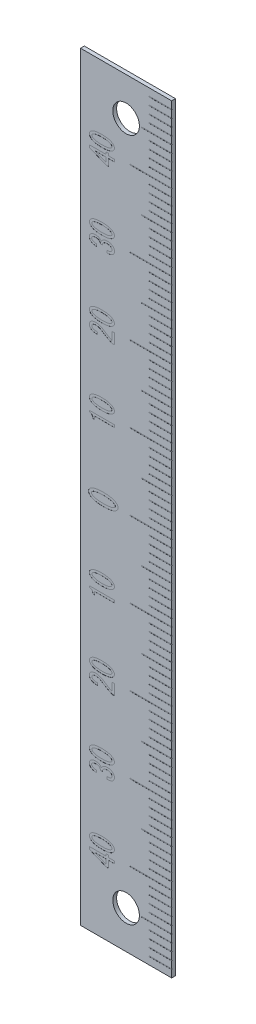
from build123d import *

# Parameters (mm, degrees)
SKETCH1_W      = 12
SKETCH1_H      = 100
EXTRUDE1_DEPTH = 0.5
SKETCH2_R      = 1.75
EXTRUDE2_DEPTH = 101.718667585
EXTRUDE3_DEPTH = 0.01
SKETCH4_W      = 5.5
SKETCH4_H      = 0.1
SKETCH4_W_2    = 3
SKETCH4_W_3    = 4
EXTRUDE4_DEPTH = 0.01


with BuildPart() as part:
    # Sketch1 → Extrude1 (new body)
    with BuildSketch(Plane.XY):
        with Locations((6, 50)):
            Rectangle(SKETCH1_W, SKETCH1_H)
    extrude(amount=EXTRUDE1_DEPTH)

    # Sketch2 → Extrude2 (cut, through all)
    with BuildSketch(Plane.XY.offset(0.5)):
        with Locations((6, 5)):
            Circle(SKETCH2_R)
        with Locations((6, 95)):
            Circle(SKETCH2_R)
    extrude(amount=-EXTRUDE2_DEPTH, mode=Mode.SUBTRACT)

    # Sketch3 → Extrude3 (cut)
    # profile 1 of 17: a face of its own
    with BuildSketch(Plane.XY.offset(0.5)):
        Polygon((4.464202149, 89.253595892), (4.076078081, 89.253595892), (3.68481385, 89.253595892), (3.68481385, 88.358021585), (3.363889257, 88.358021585), (1.159495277, 89.263016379), (1.159495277, 89.57326442), (3.363889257, 89.57326442), (3.363889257, 89.857135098), (3.68481385, 89.857135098), (3.68481385, 89.57326442), (4.464202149, 89.57326442), align=None)
        Polygon((3.363889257, 89.253595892), (1.871684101, 89.253595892), (3.363889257, 88.655080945), align=None, mode=Mode.SUBTRACT)
    # profile 2 of 17: a face of its own
    with BuildSketch(Plane.XY.offset(0.5)):
        with BuildLine():
            add(Edge.make_bspline(
                [(2.804312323, 90.08636695), (2.763487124, 90.086598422), (2.683284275, 90.087053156), (2.565184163, 90.090916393), (2.451677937, 90.097059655), (2.342790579, 90.105920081), (2.238418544, 90.116877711), (2.138826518, 90.131643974), (2.043659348, 90.147711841), (1.953367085, 90.166540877), (1.867534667, 90.187646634), (1.786660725, 90.212475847), (1.709981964, 90.238496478), (1.63792646, 90.267351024), (1.571052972, 90.299483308), (1.508231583, 90.333293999), (1.450513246, 90.370357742), (1.414537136, 90.397244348), (1.396891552, 90.410431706)],
                knots=[0, 0, 0, 0, 1.334199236, 2.621091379, 3.861325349, 5.048806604, 6.191184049, 7.29033474, 8.338632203, 9.344988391, 10.304094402, 11.226124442, 12.10888774, 12.949942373, 13.760906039, 14.53244093, 15.280190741, 16, 16, 16, 16], degree=3))
            add(Edge.make_bspline(
                [(1.396891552, 90.410431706), (1.377886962, 90.425936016), (1.341081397, 90.455962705), (1.293642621, 90.506288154), (1.25209867, 90.556343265), (1.218531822, 90.608467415), (1.191781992, 90.661574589), (1.173561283, 90.716630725), (1.161657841, 90.77250316), (1.160214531, 90.810429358), (1.159495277, 90.829329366)],
                knots=[0, 0, 0, 0, 1.179273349, 2.283859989, 3.322502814, 4.306324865, 5.261663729, 6.17616916, 7.091118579, 8, 8, 8, 8], degree=3))
            add(Edge.make_bspline(
                [(1.159495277, 90.829329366), (1.160212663, 90.848230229), (1.161652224, 90.886158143), (1.17358392, 90.942017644), (1.191636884, 90.996945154), (1.218688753, 91.049705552), (1.252296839, 91.101723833), (1.293217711, 91.152330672), (1.341340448, 91.202029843), (1.377935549, 91.232049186), (1.396891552, 91.247598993)],
                knots=[0, 0, 0, 0, 0.909839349, 1.825753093, 2.741222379, 3.688535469, 4.673394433, 5.720979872, 6.819483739, 8, 8, 8, 8], degree=3))
            add(Edge.make_bspline(
                [(1.396891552, 91.247598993), (1.414537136, 91.260786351), (1.450513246, 91.287672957), (1.508231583, 91.3247367), (1.571052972, 91.358547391), (1.63792646, 91.390679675), (1.709981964, 91.419534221), (1.786660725, 91.445554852), (1.867534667, 91.470384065), (1.953367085, 91.491489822), (2.043659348, 91.510318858), (2.138826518, 91.526386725), (2.238418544, 91.541152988), (2.342790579, 91.552110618), (2.451677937, 91.560971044), (2.565184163, 91.567114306), (2.683284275, 91.570977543), (2.763487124, 91.571432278), (2.804312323, 91.571663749)],
                knots=[0, 0, 0, 0, 0.719809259, 1.46755907, 2.239093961, 3.050057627, 3.89111226, 4.773875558, 5.695905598, 6.655011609, 7.661367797, 8.70966526, 9.808815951, 10.951193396, 12.138674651, 13.378908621, 14.665800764, 16, 16, 16, 16], degree=3))
            add(Edge.make_bspline(
                [(2.804312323, 91.571663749), (2.845974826, 91.571432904), (2.927642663, 91.570980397), (3.047627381, 91.567132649), (3.162805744, 91.560946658), (3.273365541, 91.552091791), (3.379218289, 91.541255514), (3.480042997, 91.52631378), (3.576267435, 91.510328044), (3.667806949, 91.49146689), (3.75471717, 91.470480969), (3.836402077, 91.445542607), (3.913707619, 91.419531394), (3.986394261, 91.390685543), (4.053875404, 91.358519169), (4.117234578, 91.324907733), (4.175058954, 91.28765614), (4.211041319, 91.260780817), (4.228689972, 91.247598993)],
                knots=[0, 0, 0, 0, 1.346341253, 2.639130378, 3.8790076, 5.073442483, 6.223226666, 7.316783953, 8.366697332, 9.375051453, 10.336565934, 11.254764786, 12.134057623, 12.971986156, 13.779994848, 14.548849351, 15.288238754, 16, 16, 16, 16], degree=3))
            add(Edge.make_bspline(
                [(4.228689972, 91.247598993), (4.247351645, 91.231964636), (4.283604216, 91.201592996), (4.332476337, 91.152791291), (4.372490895, 91.101447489), (4.406527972, 91.049937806), (4.432289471, 90.996615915), (4.451811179, 90.942259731), (4.462410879, 90.886054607), (4.464024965, 90.848209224), (4.464830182, 90.829329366)],
                knots=[0, 0, 0, 0, 1.1743338, 2.28128622, 3.323893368, 4.309986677, 5.254013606, 6.173907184, 7.08902033, 8, 8, 8, 8], degree=3))
            add(Edge.make_bspline(
                [(4.464830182, 90.829329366), (4.464023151, 90.81045032), (4.462405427, 90.772606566), (4.45183315, 90.716389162), (4.432141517, 90.661902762), (4.406685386, 90.608236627), (4.372691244, 90.556620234), (4.332051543, 90.505827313), (4.283860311, 90.456400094), (4.247399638, 90.426020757), (4.228689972, 90.410431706)],
                knots=[0, 0, 0, 0, 0.910025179, 1.824179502, 2.743109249, 3.69522398, 4.680284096, 5.713901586, 6.826896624, 8, 8, 8, 8], degree=3))
            add(Edge.make_bspline(
                [(4.228689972, 90.410431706), (4.211041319, 90.397249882), (4.175058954, 90.370374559), (4.117234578, 90.333122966), (4.053875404, 90.29951153), (3.986394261, 90.267345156), (3.913707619, 90.238499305), (3.836402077, 90.212488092), (3.75471717, 90.18754973), (3.667806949, 90.166563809), (3.576267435, 90.147702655), (3.480042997, 90.131716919), (3.379218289, 90.116775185), (3.273365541, 90.105938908), (3.162805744, 90.097084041), (3.047627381, 90.09089805), (2.927642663, 90.087050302), (2.845974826, 90.086597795), (2.804312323, 90.08636695)],
                knots=[0, 0, 0, 0, 0.711761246, 1.451150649, 2.220005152, 3.028013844, 3.865942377, 4.745235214, 5.663434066, 6.624948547, 7.633302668, 8.683216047, 9.776773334, 10.926557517, 12.1209924, 13.360869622, 14.653658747, 16, 16, 16, 16], degree=3))
        make_face()
        with BuildLine():
            add(Edge.make_bspline(
                [(2.804312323, 91.261415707), (2.767676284, 91.261069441), (2.695861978, 91.260390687), (2.590316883, 91.258165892), (2.489150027, 91.253278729), (2.392481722, 91.245290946), (2.30022693, 91.237179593), (2.212814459, 91.225295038), (2.129718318, 91.213328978), (2.051258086, 91.197943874), (1.97692929, 91.181420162), (1.907398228, 91.16150603), (1.841873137, 91.141413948), (1.781453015, 91.117852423), (1.725379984, 91.092883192), (1.673815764, 91.065786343), (1.626168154, 91.037204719), (1.597468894, 91.015283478), (1.583417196, 91.004550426)],
                knots=[0, 0, 0, 0, 1.387476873, 2.71974516, 3.997715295, 5.222316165, 6.392993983, 7.5041764, 8.562605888, 9.571696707, 10.531368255, 11.445041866, 12.310057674, 13.125709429, 13.899281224, 14.633331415, 15.330853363, 16, 16, 16, 16], degree=3))
            add(Edge.make_bspline(
                [(1.583417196, 91.004550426), (1.567942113, 90.991309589), (1.538992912, 90.966539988), (1.506840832, 90.922559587), (1.485224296, 90.87705391), (1.482844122, 90.845041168), (1.481675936, 90.829329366)],
                knots=[0, 0, 0, 0, 1.162721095, 2.175099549, 3.10434177, 4, 4, 4, 4], degree=3))
            add(Edge.make_bspline(
                [(1.481675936, 90.829329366), (1.482836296, 90.813611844), (1.485200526, 90.781587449), (1.507018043, 90.736019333), (1.538753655, 90.691521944), (1.567903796, 90.666693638), (1.583417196, 90.653480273)],
                knots=[0, 0, 0, 0, 0.893494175, 1.820491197, 2.840088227, 4, 4, 4, 4], degree=3))
            add(Edge.make_bspline(
                [(1.583417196, 90.653480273), (1.598156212, 90.643035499), (1.628454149, 90.621564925), (1.677291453, 90.592299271), (1.730299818, 90.565060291), (1.787887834, 90.540907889), (1.849363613, 90.517529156), (1.915145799, 90.496237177), (1.985227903, 90.477516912), (2.059390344, 90.460570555), (2.137959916, 90.445608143), (2.220652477, 90.432335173), (2.307623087, 90.421817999), (2.398748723, 90.413272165), (2.494176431, 90.405404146), (2.593874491, 90.400498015), (2.697746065, 90.398267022), (2.768304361, 90.397589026), (2.804312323, 90.397243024)],
                knots=[0, 0, 0, 0, 0.684573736, 1.407229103, 2.156074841, 2.941731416, 3.772993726, 4.648817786, 5.561264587, 6.521855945, 7.531913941, 8.592575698, 9.69595549, 10.851956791, 12.06190895, 13.325252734, 14.634998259, 16, 16, 16, 16], degree=3))
            add(Edge.make_bspline(
                [(2.804312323, 90.397243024), (2.841785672, 90.397588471), (2.915065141, 90.398263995), (3.022703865, 90.400490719), (3.125541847, 90.405385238), (3.223691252, 90.413273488), (3.317323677, 90.421841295), (3.406404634, 90.432229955), (3.490753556, 90.445635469), (3.570391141, 90.460491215), (3.645369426, 90.477539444), (3.715901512, 90.496147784), (3.781702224, 90.517419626), (3.842729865, 90.540898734), (3.899661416, 90.565104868), (3.951853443, 90.591966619), (3.99904188, 90.621590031), (4.028053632, 90.643045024), (4.042164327, 90.653480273)],
                knots=[0, 0, 0, 0, 1.401046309, 2.739758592, 4.0248449, 5.249399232, 6.420696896, 7.540008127, 8.601571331, 9.613140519, 10.568176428, 11.475655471, 12.339456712, 13.151990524, 13.919674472, 14.651282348, 15.344012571, 16, 16, 16, 16], degree=3))
            add(Edge.make_bspline(
                [(4.042164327, 90.653480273), (4.057596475, 90.666746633), (4.086687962, 90.691755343), (4.119429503, 90.735654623), (4.140196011, 90.781762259), (4.142682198, 90.813642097), (4.143905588, 90.829329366)],
                knots=[0, 0, 0, 0, 1.159232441, 2.18529495, 3.107029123, 4, 4, 4, 4], degree=3))
            add(Edge.make_bspline(
                [(4.143905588, 90.829329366), (4.142674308, 90.845010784), (4.140172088, 90.876878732), (4.119603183, 90.922925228), (4.086449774, 90.966304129), (4.057558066, 90.991255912), (4.042164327, 91.004550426)],
                knots=[0, 0, 0, 0, 0.89511734, 1.819067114, 2.837981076, 4, 4, 4, 4], degree=3))
            add(Edge.make_bspline(
                [(4.042164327, 91.004550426), (4.028109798, 91.015278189), (3.999404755, 91.037188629), (3.95164342, 91.065951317), (3.899548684, 91.092855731), (3.842868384, 91.117856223), (3.781814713, 91.14140776), (3.715668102, 91.161504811), (3.64550559, 91.181409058), (3.570358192, 91.198018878), (3.490830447, 91.213306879), (3.406283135, 91.225349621), (3.317389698, 91.237124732), (3.22367965, 91.245296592), (3.125545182, 91.253298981), (3.022702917, 91.258160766), (2.915065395, 91.26039668), (2.841785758, 91.261070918), (2.804312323, 91.261415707)],
                knots=[0, 0, 0, 0, 0.660466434, 1.348940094, 2.080407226, 2.851088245, 3.663465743, 4.524722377, 5.434082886, 6.388935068, 7.400309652, 8.46048529, 9.580538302, 10.751610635, 11.975929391, 13.260768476, 14.599223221, 16, 16, 16, 16], degree=3))
        make_face(mode=Mode.SUBTRACT)
    # profile 3 of 17: a face of its own
    with BuildSketch(Plane.XY.offset(0.5)):
        with BuildLine():
            add(Edge.make_bspline(
                [(3.482587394, 78.709091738), (3.512525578, 78.708287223), (3.570543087, 78.706728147), (3.654420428, 78.710760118), (3.732130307, 78.718455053), (3.803298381, 78.73168567), (3.868273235, 78.749141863), (3.927053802, 78.770782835), (3.979378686, 78.79791141), (4.010164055, 78.820091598), (4.025207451, 78.830930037)],
                knots=[0, 0, 0, 0, 1.267087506, 2.455501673, 3.55133733, 4.569646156, 5.515332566, 6.395721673, 7.21606285, 8, 8, 8, 8], degree=3))
            add(Edge.make_bspline(
                [(4.025207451, 78.830930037), (4.043506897, 78.847280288), (4.079345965, 78.8793019), (4.117183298, 78.941459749), (4.139871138, 79.011713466), (4.142530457, 79.061449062), (4.143905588, 79.087167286)],
                knots=[0, 0, 0, 0, 1.002413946, 1.963205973, 2.946775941, 4, 4, 4, 4], degree=3))
            add(Edge.make_bspline(
                [(4.143905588, 79.087167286), (4.14205895, 79.10966892), (4.138250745, 79.15607263), (4.10631016, 79.222801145), (4.057507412, 79.287350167), (4.014319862, 79.324320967), (3.991293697, 79.344032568)],
                knots=[0, 0, 0, 0, 0.87119639, 1.796613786, 2.82522778, 4, 4, 4, 4], degree=3))
            add(Edge.make_bspline(
                [(3.991293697, 79.344032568), (3.977715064, 79.35383947), (3.949615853, 79.374133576), (3.90102721, 79.398039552), (3.847048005, 79.41973801), (3.786272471, 79.436247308), (3.719328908, 79.449449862), (3.646079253, 79.458528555), (3.566417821, 79.464292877), (3.511278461, 79.464917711), (3.482587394, 79.465242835)],
                knots=[0, 0, 0, 0, 0.754595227, 1.561536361, 2.43511806, 3.377163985, 4.397951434, 5.512234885, 6.705522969, 8, 8, 8, 8], degree=3))
            add(Edge.make_bspline(
                [(3.482587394, 79.465242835), (3.460377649, 79.46473344), (3.416687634, 79.463731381), (3.35267071, 79.456647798), (3.291236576, 79.44559945), (3.232735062, 79.428991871), (3.176430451, 79.40846888), (3.123062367, 79.382368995), (3.071883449, 79.352579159), (3.040443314, 79.328863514), (3.024751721, 79.317027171)],
                knots=[0, 0, 0, 0, 1.086352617, 2.137024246, 3.147391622, 4.136355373, 5.10847195, 6.074961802, 7.039224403, 8, 8, 8, 8], degree=3))
            add(Edge.make_bspline(
                [(3.024751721, 79.317027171), (3.014022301, 79.307663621), (2.992758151, 79.289106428), (2.965670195, 79.256771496), (2.94319759, 79.221167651), (2.926529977, 79.181802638), (2.913593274, 79.139332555), (2.906578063, 79.093273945), (2.903067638, 79.044064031), (2.905038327, 79.010337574), (2.906053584, 78.992962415)],
                knots=[0, 0, 0, 0, 0.947861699, 1.87852391, 2.799832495, 3.743268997, 4.71875736, 5.750864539, 6.841292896, 8, 8, 8, 8], degree=3))
            Line((2.906053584, 78.992962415), (2.617786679, 78.992962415))
            add(Edge.make_bspline(
                [(2.617786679, 78.992962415), (2.615917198, 79.01036469), (2.61227151, 79.044300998), (2.603170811, 79.09366086), (2.589082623, 79.139312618), (2.572365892, 79.182135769), (2.550836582, 79.220887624), (2.526138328, 79.256550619), (2.497813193, 79.288974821), (2.476089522, 79.307646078), (2.465174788, 79.317027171)],
                knots=[0, 0, 0, 0, 1.139052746, 2.221275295, 3.260086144, 4.244297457, 5.207730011, 6.137529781, 7.064229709, 8, 8, 8, 8], degree=3))
            add(Edge.make_bspline(
                [(2.465174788, 79.317027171), (2.453430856, 79.325692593), (2.429384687, 79.343435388), (2.388683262, 79.365118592), (2.344024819, 79.38418922), (2.294826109, 79.398815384), (2.241812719, 79.411043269), (2.184417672, 79.41879032), (2.12278159, 79.423939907), (2.080202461, 79.42467109), (2.058209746, 79.425048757)],
                knots=[0, 0, 0, 0, 0.816014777, 1.670822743, 2.574059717, 3.530392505, 4.539613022, 5.616822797, 6.769055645, 8, 8, 8, 8], degree=3))
            add(Edge.make_bspline(
                [(2.058209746, 79.425048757), (2.030985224, 79.424710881), (1.978357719, 79.424057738), (1.902231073, 79.418395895), (1.831762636, 79.409047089), (1.766898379, 79.396390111), (1.708285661, 79.3784051), (1.654956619, 79.358063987), (1.60766056, 79.33316966), (1.579858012, 79.312952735), (1.56646032, 79.303210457)],
                knots=[0, 0, 0, 0, 1.267211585, 2.44963652, 3.550842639, 4.575246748, 5.5217347, 6.401234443, 7.229575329, 8, 8, 8, 8], degree=3))
            add(Edge.make_bspline(
                [(1.56646032, 79.303210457), (1.550800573, 79.289680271), (1.520516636, 79.263514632), (1.489112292, 79.21338768), (1.467772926, 79.159180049), (1.465751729, 79.120663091), (1.464719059, 79.100984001)],
                knots=[0, 0, 0, 0, 1.053722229, 2.037763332, 2.997453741, 4, 4, 4, 4], degree=3))
            add(Edge.make_bspline(
                [(1.464719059, 79.100984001), (1.465793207, 79.081323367), (1.467906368, 79.0426452), (1.488749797, 78.988170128), (1.520925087, 78.938367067), (1.550860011, 78.911914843), (1.56646032, 78.898129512)],
                knots=[0, 0, 0, 0, 1.000412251, 1.968100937, 2.94109465, 4, 4, 4, 4], degree=3))
            add(Edge.make_bspline(
                [(1.56646032, 78.898129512), (1.581277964, 78.887055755), (1.611428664, 78.864523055), (1.662612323, 78.837488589), (1.718046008, 78.812216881), (1.779698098, 78.793150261), (1.845928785, 78.775455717), (1.917710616, 78.763754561), (1.994531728, 78.75366975), (2.047707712, 78.75119286), (2.075166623, 78.749913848)],
                knots=[0, 0, 0, 0, 0.823448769, 1.675540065, 2.573857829, 3.535986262, 4.547798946, 5.627975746, 6.775138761, 8, 8, 8, 8], degree=3))
            Line((2.075166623, 78.749913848), (2.075166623, 78.452854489))
            add(Edge.make_bspline(
                [(2.075166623, 78.452854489), (2.039320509, 78.454383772), (1.969081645, 78.457380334), (1.86662153, 78.471341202), (1.769148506, 78.489228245), (1.677509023, 78.515831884), (1.590488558, 78.54647123), (1.509243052, 78.585395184), (1.432662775, 78.629471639), (1.386090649, 78.664635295), (1.362977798, 78.682086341)],
                knots=[0, 0, 0, 0, 1.130465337, 2.215096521, 3.257023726, 4.251490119, 5.220175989, 6.161913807, 7.087793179, 8, 8, 8, 8], degree=3))
            add(Edge.make_bspline(
                [(1.362977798, 78.682086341), (1.3467956, 78.695809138), (1.31513049, 78.722661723), (1.272968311, 78.767477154), (1.238724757, 78.816404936), (1.209237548, 78.867139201), (1.18725208, 78.92158891), (1.170766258, 78.978543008), (1.161240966, 79.038909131), (1.160084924, 79.080016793), (1.159495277, 79.100984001)],
                knots=[0, 0, 0, 0, 1.054146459, 2.062739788, 3.04727221, 4.0164563, 4.972878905, 5.957576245, 6.958249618, 8, 8, 8, 8], degree=3))
            add(Edge.make_bspline(
                [(1.159495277, 79.100984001), (1.160084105, 79.122995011), (1.161233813, 79.165972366), (1.17065538, 79.228867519), (1.187412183, 79.288028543), (1.208926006, 79.344536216), (1.238532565, 79.396768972), (1.273183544, 79.446397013), (1.314699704, 79.492477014), (1.346729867, 79.519408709), (1.362977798, 79.533070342)],
                knots=[0, 0, 0, 0, 1.066551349, 2.082482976, 3.072030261, 4.042353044, 5.005167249, 5.973525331, 6.972030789, 8, 8, 8, 8], degree=3))
            add(Edge.make_bspline(
                [(1.362977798, 79.533070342), (1.383180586, 79.548391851), (1.423800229, 79.579197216), (1.49101211, 79.617407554), (1.563031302, 79.649133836), (1.639054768, 79.676462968), (1.720201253, 79.697274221), (1.806188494, 79.711237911), (1.896823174, 79.720285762), (1.958748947, 79.721491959), (1.990382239, 79.722108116)],
                knots=[0, 0, 0, 0, 0.910342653, 1.830331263, 2.769796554, 3.735781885, 4.730142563, 5.775142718, 6.863485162, 8, 8, 8, 8], degree=3))
            add(Edge.make_bspline(
                [(1.990382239, 79.722108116), (2.019286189, 79.72161156), (2.075295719, 79.720649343), (2.156472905, 79.713669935), (2.232474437, 79.70249683), (2.303229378, 79.686672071), (2.368446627, 79.664650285), (2.428974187, 79.640082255), (2.484286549, 79.610093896), (2.516949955, 79.585400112), (2.533002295, 79.57326442)],
                knots=[0, 0, 0, 0, 1.210143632, 2.344993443, 3.40861805, 4.424997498, 5.37575867, 6.287368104, 7.158331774, 8, 8, 8, 8], degree=3))
            add(Edge.make_bspline(
                [(2.533002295, 79.57326442), (2.559175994, 79.551536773), (2.608490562, 79.51059913), (2.671793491, 79.445781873), (2.721317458, 79.38266922), (2.743208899, 79.337936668), (2.753441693, 79.317027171)],
                knots=[0, 0, 0, 0, 1.195517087, 2.252505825, 3.183162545, 4, 4, 4, 4], degree=3))
            add(Edge.make_bspline(
                [(2.753441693, 79.317027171), (2.765088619, 79.34500906), (2.787538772, 79.398945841), (2.831763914, 79.47199791), (2.881380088, 79.535717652), (2.920772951, 79.570253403), (2.939967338, 79.587081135)],
                knots=[0, 0, 0, 0, 1.094399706, 2.109521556, 3.078854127, 4, 4, 4, 4], degree=3))
            add(Edge.make_bspline(
                [(2.939967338, 79.587081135), (2.959994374, 79.60234586), (2.999821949, 79.632702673), (3.064355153, 79.670989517), (3.132227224, 79.703077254), (3.202874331, 79.730156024), (3.276856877, 79.751027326), (3.354027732, 79.765256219), (3.434226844, 79.774233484), (3.488843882, 79.775485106), (3.516501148, 79.776118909)],
                knots=[0, 0, 0, 0, 0.976244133, 1.941447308, 2.904084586, 3.885987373, 4.873249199, 5.881498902, 6.927222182, 8, 8, 8, 8], degree=3))
            add(Edge.make_bspline(
                [(3.516501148, 79.776118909), (3.552324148, 79.77559206), (3.622443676, 79.774560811), (3.725084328, 79.764261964), (3.822576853, 79.747624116), (3.914506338, 79.72361205), (4.001245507, 79.69357359), (4.082537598, 79.656250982), (4.159144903, 79.612707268), (4.205595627, 79.577553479), (4.228689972, 79.560075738)],
                knots=[0, 0, 0, 0, 1.13285732, 2.217441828, 3.259318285, 4.258350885, 5.219645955, 6.158999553, 7.084692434, 8, 8, 8, 8], degree=3))
            add(Edge.make_bspline(
                [(4.228689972, 79.560075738), (4.247408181, 79.544073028), (4.284031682, 79.512762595), (4.332853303, 79.461250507), (4.373280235, 79.40591535), (4.406871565, 79.348128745), (4.432721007, 79.287091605), (4.451971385, 79.223397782), (4.462541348, 79.156184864), (4.464058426, 79.110438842), (4.464830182, 79.087167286)],
                knots=[0, 0, 0, 0, 1.078182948, 2.109541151, 3.099814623, 4.073306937, 5.030426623, 5.996463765, 6.980776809, 8, 8, 8, 8], degree=3))
            add(Edge.make_bspline(
                [(4.464830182, 79.087167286), (4.464367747, 79.062001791), (4.463461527, 79.012685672), (4.452274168, 78.941195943), (4.435512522, 78.873719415), (4.411441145, 78.810497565), (4.38066456, 78.751121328), (4.342591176, 78.696168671), (4.297876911, 78.645289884), (4.263207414, 78.615937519), (4.245646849, 78.601070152)],
                knots=[0, 0, 0, 0, 1.091653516, 2.139282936, 3.133504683, 4.105839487, 5.069340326, 6.029921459, 7.002128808, 8, 8, 8, 8], degree=3))
            add(Edge.make_bspline(
                [(4.245646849, 78.601070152), (4.223356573, 78.584883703), (4.177849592, 78.551838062), (4.101818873, 78.510403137), (4.01783525, 78.476087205), (3.926096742, 78.448030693), (3.826687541, 78.425207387), (3.71890008, 78.410072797), (3.603344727, 78.400491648), (3.523639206, 78.399403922), (3.482587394, 78.398843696)],
                knots=[0, 0, 0, 0, 0.821972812, 1.678108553, 2.577822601, 3.526913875, 4.539938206, 5.620279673, 6.774340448, 8, 8, 8, 8], degree=3))
            Line((3.482587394, 78.398843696), (3.482587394, 78.709091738))
        make_face()
    # profile 4 of 17: a face of its own
    with BuildSketch(Plane.XY.offset(0.5)):
        with BuildLine():
            add(Edge.make_bspline(
                [(2.804312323, 80.08636695), (2.763487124, 80.086598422), (2.683284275, 80.087053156), (2.565184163, 80.090916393), (2.451677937, 80.097059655), (2.342790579, 80.105920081), (2.238418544, 80.116877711), (2.138826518, 80.131643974), (2.043659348, 80.147711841), (1.953367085, 80.166540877), (1.867534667, 80.187646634), (1.786660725, 80.212475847), (1.709981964, 80.238496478), (1.63792646, 80.267351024), (1.571052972, 80.299483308), (1.508231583, 80.333293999), (1.450513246, 80.370357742), (1.414537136, 80.397244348), (1.396891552, 80.410431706)],
                knots=[0, 0, 0, 0, 1.334199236, 2.621091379, 3.861325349, 5.048806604, 6.191184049, 7.29033474, 8.338632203, 9.344988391, 10.304094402, 11.226124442, 12.10888774, 12.949942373, 13.760906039, 14.53244093, 15.280190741, 16, 16, 16, 16], degree=3))
            add(Edge.make_bspline(
                [(1.396891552, 80.410431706), (1.377886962, 80.425936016), (1.341081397, 80.455962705), (1.293642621, 80.506288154), (1.25209867, 80.556343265), (1.218531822, 80.608467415), (1.191781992, 80.661574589), (1.173561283, 80.716630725), (1.161657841, 80.77250316), (1.160214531, 80.810429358), (1.159495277, 80.829329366)],
                knots=[0, 0, 0, 0, 1.179273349, 2.283859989, 3.322502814, 4.306324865, 5.261663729, 6.17616916, 7.091118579, 8, 8, 8, 8], degree=3))
            add(Edge.make_bspline(
                [(1.159495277, 80.829329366), (1.160212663, 80.848230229), (1.161652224, 80.886158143), (1.17358392, 80.942017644), (1.191636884, 80.996945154), (1.218688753, 81.049705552), (1.252296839, 81.101723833), (1.293217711, 81.152330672), (1.341340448, 81.202029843), (1.377935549, 81.232049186), (1.396891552, 81.247598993)],
                knots=[0, 0, 0, 0, 0.909839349, 1.825753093, 2.741222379, 3.688535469, 4.673394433, 5.720979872, 6.819483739, 8, 8, 8, 8], degree=3))
            add(Edge.make_bspline(
                [(1.396891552, 81.247598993), (1.414537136, 81.260786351), (1.450513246, 81.287672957), (1.508231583, 81.3247367), (1.571052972, 81.358547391), (1.63792646, 81.390679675), (1.709981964, 81.419534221), (1.786660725, 81.445554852), (1.867534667, 81.470384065), (1.953367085, 81.491489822), (2.043659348, 81.510318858), (2.138826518, 81.526386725), (2.238418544, 81.541152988), (2.342790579, 81.552110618), (2.451677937, 81.560971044), (2.565184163, 81.567114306), (2.683284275, 81.570977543), (2.763487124, 81.571432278), (2.804312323, 81.571663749)],
                knots=[0, 0, 0, 0, 0.719809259, 1.46755907, 2.239093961, 3.050057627, 3.89111226, 4.773875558, 5.695905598, 6.655011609, 7.661367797, 8.70966526, 9.808815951, 10.951193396, 12.138674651, 13.378908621, 14.665800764, 16, 16, 16, 16], degree=3))
            add(Edge.make_bspline(
                [(2.804312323, 81.571663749), (2.845974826, 81.571432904), (2.927642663, 81.570980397), (3.047627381, 81.567132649), (3.162805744, 81.560946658), (3.273365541, 81.552091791), (3.379218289, 81.541255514), (3.480042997, 81.52631378), (3.576267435, 81.510328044), (3.667806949, 81.49146689), (3.75471717, 81.470480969), (3.836402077, 81.445542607), (3.913707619, 81.419531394), (3.986394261, 81.390685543), (4.053875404, 81.358519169), (4.117234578, 81.324907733), (4.175058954, 81.28765614), (4.211041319, 81.260780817), (4.228689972, 81.247598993)],
                knots=[0, 0, 0, 0, 1.346341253, 2.639130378, 3.8790076, 5.073442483, 6.223226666, 7.316783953, 8.366697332, 9.375051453, 10.336565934, 11.254764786, 12.134057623, 12.971986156, 13.779994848, 14.548849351, 15.288238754, 16, 16, 16, 16], degree=3))
            add(Edge.make_bspline(
                [(4.228689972, 81.247598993), (4.247351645, 81.231964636), (4.283604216, 81.201592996), (4.332476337, 81.152791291), (4.372490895, 81.101447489), (4.406527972, 81.049937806), (4.432289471, 80.996615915), (4.451811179, 80.942259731), (4.462410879, 80.886054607), (4.464024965, 80.848209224), (4.464830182, 80.829329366)],
                knots=[0, 0, 0, 0, 1.1743338, 2.28128622, 3.323893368, 4.309986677, 5.254013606, 6.173907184, 7.08902033, 8, 8, 8, 8], degree=3))
            add(Edge.make_bspline(
                [(4.464830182, 80.829329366), (4.464023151, 80.81045032), (4.462405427, 80.772606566), (4.45183315, 80.716389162), (4.432141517, 80.661902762), (4.406685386, 80.608236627), (4.372691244, 80.556620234), (4.332051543, 80.505827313), (4.283860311, 80.456400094), (4.247399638, 80.426020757), (4.228689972, 80.410431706)],
                knots=[0, 0, 0, 0, 0.910025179, 1.824179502, 2.743109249, 3.69522398, 4.680284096, 5.713901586, 6.826896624, 8, 8, 8, 8], degree=3))
            add(Edge.make_bspline(
                [(4.228689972, 80.410431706), (4.211041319, 80.397249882), (4.175058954, 80.370374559), (4.117234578, 80.333122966), (4.053875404, 80.29951153), (3.986394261, 80.267345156), (3.913707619, 80.238499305), (3.836402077, 80.212488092), (3.75471717, 80.18754973), (3.667806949, 80.166563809), (3.576267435, 80.147702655), (3.480042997, 80.131716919), (3.379218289, 80.116775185), (3.273365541, 80.105938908), (3.162805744, 80.097084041), (3.047627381, 80.09089805), (2.927642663, 80.087050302), (2.845974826, 80.086597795), (2.804312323, 80.08636695)],
                knots=[0, 0, 0, 0, 0.711761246, 1.451150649, 2.220005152, 3.028013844, 3.865942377, 4.745235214, 5.663434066, 6.624948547, 7.633302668, 8.683216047, 9.776773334, 10.926557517, 12.1209924, 13.360869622, 14.653658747, 16, 16, 16, 16], degree=3))
        make_face()
        with BuildLine():
            add(Edge.make_bspline(
                [(2.804312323, 81.261415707), (2.767676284, 81.261069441), (2.695861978, 81.260390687), (2.590316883, 81.258165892), (2.489150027, 81.253278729), (2.392481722, 81.245290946), (2.30022693, 81.237179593), (2.212814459, 81.225295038), (2.129718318, 81.213328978), (2.051258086, 81.197943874), (1.97692929, 81.181420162), (1.907398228, 81.16150603), (1.841873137, 81.141413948), (1.781453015, 81.117852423), (1.725379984, 81.092883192), (1.673815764, 81.065786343), (1.626168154, 81.037204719), (1.597468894, 81.015283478), (1.583417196, 81.004550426)],
                knots=[0, 0, 0, 0, 1.387476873, 2.71974516, 3.997715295, 5.222316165, 6.392993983, 7.5041764, 8.562605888, 9.571696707, 10.531368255, 11.445041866, 12.310057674, 13.125709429, 13.899281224, 14.633331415, 15.330853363, 16, 16, 16, 16], degree=3))
            add(Edge.make_bspline(
                [(1.583417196, 81.004550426), (1.567942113, 80.991309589), (1.538992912, 80.966539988), (1.506840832, 80.922559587), (1.485224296, 80.87705391), (1.482844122, 80.845041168), (1.481675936, 80.829329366)],
                knots=[0, 0, 0, 0, 1.162721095, 2.175099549, 3.10434177, 4, 4, 4, 4], degree=3))
            add(Edge.make_bspline(
                [(1.481675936, 80.829329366), (1.482836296, 80.813611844), (1.485200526, 80.781587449), (1.507018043, 80.736019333), (1.538753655, 80.691521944), (1.567903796, 80.666693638), (1.583417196, 80.653480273)],
                knots=[0, 0, 0, 0, 0.893494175, 1.820491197, 2.840088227, 4, 4, 4, 4], degree=3))
            add(Edge.make_bspline(
                [(1.583417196, 80.653480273), (1.598156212, 80.643035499), (1.628454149, 80.621564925), (1.677291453, 80.592299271), (1.730299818, 80.565060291), (1.787887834, 80.540907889), (1.849363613, 80.517529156), (1.915145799, 80.496237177), (1.985227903, 80.477516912), (2.059390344, 80.460570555), (2.137959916, 80.445608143), (2.220652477, 80.432335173), (2.307623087, 80.421817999), (2.398748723, 80.413272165), (2.494176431, 80.405404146), (2.593874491, 80.400498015), (2.697746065, 80.398267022), (2.768304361, 80.397589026), (2.804312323, 80.397243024)],
                knots=[0, 0, 0, 0, 0.684573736, 1.407229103, 2.156074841, 2.941731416, 3.772993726, 4.648817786, 5.561264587, 6.521855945, 7.531913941, 8.592575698, 9.69595549, 10.851956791, 12.06190895, 13.325252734, 14.634998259, 16, 16, 16, 16], degree=3))
            add(Edge.make_bspline(
                [(2.804312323, 80.397243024), (2.841785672, 80.397588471), (2.915065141, 80.398263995), (3.022703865, 80.400490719), (3.125541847, 80.405385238), (3.223691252, 80.413273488), (3.317323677, 80.421841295), (3.406404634, 80.432229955), (3.490753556, 80.445635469), (3.570391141, 80.460491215), (3.645369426, 80.477539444), (3.715901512, 80.496147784), (3.781702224, 80.517419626), (3.842729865, 80.540898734), (3.899661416, 80.565104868), (3.951853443, 80.591966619), (3.99904188, 80.621590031), (4.028053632, 80.643045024), (4.042164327, 80.653480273)],
                knots=[0, 0, 0, 0, 1.401046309, 2.739758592, 4.0248449, 5.249399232, 6.420696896, 7.540008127, 8.601571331, 9.613140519, 10.568176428, 11.475655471, 12.339456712, 13.151990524, 13.919674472, 14.651282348, 15.344012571, 16, 16, 16, 16], degree=3))
            add(Edge.make_bspline(
                [(4.042164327, 80.653480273), (4.057596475, 80.666746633), (4.086687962, 80.691755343), (4.119429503, 80.735654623), (4.140196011, 80.781762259), (4.142682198, 80.813642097), (4.143905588, 80.829329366)],
                knots=[0, 0, 0, 0, 1.159232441, 2.18529495, 3.107029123, 4, 4, 4, 4], degree=3))
            add(Edge.make_bspline(
                [(4.143905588, 80.829329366), (4.142674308, 80.845010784), (4.140172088, 80.876878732), (4.119603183, 80.922925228), (4.086449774, 80.966304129), (4.057558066, 80.991255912), (4.042164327, 81.004550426)],
                knots=[0, 0, 0, 0, 0.89511734, 1.819067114, 2.837981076, 4, 4, 4, 4], degree=3))
            add(Edge.make_bspline(
                [(4.042164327, 81.004550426), (4.028109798, 81.015278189), (3.999404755, 81.037188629), (3.95164342, 81.065951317), (3.899548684, 81.092855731), (3.842868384, 81.117856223), (3.781814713, 81.14140776), (3.715668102, 81.161504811), (3.64550559, 81.181409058), (3.570358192, 81.198018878), (3.490830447, 81.213306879), (3.406283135, 81.225349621), (3.317389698, 81.237124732), (3.22367965, 81.245296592), (3.125545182, 81.253298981), (3.022702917, 81.258160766), (2.915065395, 81.26039668), (2.841785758, 81.261070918), (2.804312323, 81.261415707)],
                knots=[0, 0, 0, 0, 0.660466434, 1.348940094, 2.080407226, 2.851088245, 3.663465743, 4.524722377, 5.434082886, 6.388935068, 7.400309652, 8.46048529, 9.580538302, 10.751610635, 11.975929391, 13.260768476, 14.599223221, 16, 16, 16, 16], degree=3))
        make_face(mode=Mode.SUBTRACT)
    # profile 5 of 17: a face of its own
    with BuildSketch(Plane.XY.offset(0.5)):
        with BuildLine():
            Line((4.143905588, 69.789307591), (4.464830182, 69.789307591))
            Line((4.464830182, 69.789307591), (4.464830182, 68.412032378))
            Line((4.464830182, 68.412032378), (4.194776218, 68.412032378))
            add(Edge.make_bspline(
                [(4.194776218, 68.412032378), (4.134104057, 68.438239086), (4.012820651, 68.490626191), (3.833941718, 68.576059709), (3.65666089, 68.664824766), (3.482086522, 68.759401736), (3.309323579, 68.858008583), (3.138392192, 68.960822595), (2.969988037, 69.068963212), (2.859615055, 69.144268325), (2.804312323, 69.18200019)],
                knots=[0, 0, 0, 0, 0.99614483, 1.991289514, 2.987624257, 3.984438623, 4.983697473, 5.985971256, 6.990864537, 8, 8, 8, 8], degree=3))
            add(Edge.make_bspline(
                [(2.804312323, 69.18200019), (2.773407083, 69.202561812), (2.712458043, 69.24311193), (2.617211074, 69.295150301), (2.521104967, 69.339278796), (2.423672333, 69.375332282), (2.325440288, 69.4035815), (2.22593849, 69.42388529), (2.125513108, 69.436178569), (2.058034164, 69.437551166), (2.024295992, 69.438237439)],
                knots=[0, 0, 0, 0, 1.067918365, 2.106070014, 3.119789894, 4.109153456, 5.093164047, 6.058534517, 7.029304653, 8, 8, 8, 8], degree=3))
            add(Edge.make_bspline(
                [(2.024295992, 69.438237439), (2.001046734, 69.437894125), (1.955732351, 69.437224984), (1.889860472, 69.431518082), (1.828132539, 69.422267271), (1.770797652, 69.409104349), (1.71743613, 69.392320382), (1.668710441, 69.370724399), (1.623431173, 69.346637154), (1.596599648, 69.326782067), (1.583417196, 69.317027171)],
                knots=[0, 0, 0, 0, 1.197973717, 2.334932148, 3.404529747, 4.412096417, 5.3640046, 6.281988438, 7.155932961, 8, 8, 8, 8], degree=3))
            add(Edge.make_bspline(
                [(1.583417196, 69.317027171), (1.567746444, 69.303076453), (1.537248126, 69.275925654), (1.505254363, 69.223199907), (1.484772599, 69.164442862), (1.482726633, 69.122515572), (1.481675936, 69.100984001)],
                knots=[0, 0, 0, 0, 1.01321699, 1.971916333, 2.958486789, 4, 4, 4, 4], degree=3))
            add(Edge.make_bspline(
                [(1.481675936, 69.100984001), (1.483585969, 69.082717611), (1.487575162, 69.044567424), (1.51537348, 68.988943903), (1.559276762, 68.934674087), (1.597036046, 68.902326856), (1.61733095, 68.88494083)],
                knots=[0, 0, 0, 0, 0.831770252, 1.737190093, 2.783782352, 4, 4, 4, 4], degree=3))
            add(Edge.make_bspline(
                [(1.61733095, 68.88494083), (1.63152823, 68.875101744), (1.661915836, 68.854042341), (1.715884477, 68.829594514), (1.77953563, 68.808918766), (1.853234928, 68.792609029), (1.936819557, 68.778578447), (2.030630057, 68.769762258), (2.13433812, 68.764032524), (2.206835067, 68.763421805), (2.24473539, 68.76310253)],
                knots=[0, 0, 0, 0, 0.638255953, 1.36611168, 2.182006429, 3.11234378, 4.156826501, 5.317109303, 6.597424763, 8, 8, 8, 8], degree=3))
            Line((2.24473539, 68.76310253), (2.24473539, 68.466043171))
            add(Edge.make_bspline(
                [(2.24473539, 68.466043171), (2.195515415, 68.46790543), (2.100702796, 68.471492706), (1.963728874, 68.483794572), (1.837426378, 68.503038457), (1.721668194, 68.528812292), (1.616016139, 68.559516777), (1.521404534, 68.598268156), (1.436291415, 68.64179784), (1.386844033, 68.67828985), (1.362977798, 68.695903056)],
                knots=[0, 0, 0, 0, 1.276449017, 2.458828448, 3.562299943, 4.585123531, 5.530965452, 6.409552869, 7.23235602, 8, 8, 8, 8], degree=3))
            add(Edge.make_bspline(
                [(1.362977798, 68.695903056), (1.346729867, 68.709564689), (1.314699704, 68.736496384), (1.273183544, 68.782576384), (1.238532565, 68.832204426), (1.208926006, 68.884437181), (1.187412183, 68.940944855), (1.17065538, 69.000105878), (1.161233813, 69.063001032), (1.160084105, 69.105978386), (1.159495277, 69.127989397)],
                knots=[0, 0, 0, 0, 1.027969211, 2.026474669, 2.994832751, 3.957646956, 4.927969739, 5.917517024, 6.933448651, 8, 8, 8, 8], degree=3))
            add(Edge.make_bspline(
                [(1.159495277, 69.127989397), (1.159956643, 69.148979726), (1.160867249, 69.190408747), (1.172379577, 69.250967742), (1.188861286, 69.309450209), (1.21397118, 69.364787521), (1.24481477, 69.418042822), (1.282906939, 69.468678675), (1.328294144, 69.516390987), (1.362484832, 69.545314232), (1.379934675, 69.560075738)],
                knots=[0, 0, 0, 0, 1.000230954, 1.974175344, 2.932001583, 3.893571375, 4.865053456, 5.864036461, 6.909871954, 8, 8, 8, 8], degree=3))
            add(Edge.make_bspline(
                [(1.379934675, 69.560075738), (1.400321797, 69.575446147), (1.441611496, 69.606575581), (1.510569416, 69.644342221), (1.584899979, 69.676515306), (1.664800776, 69.703727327), (1.75083857, 69.724143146), (1.84261768, 69.738396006), (1.93996472, 69.747294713), (2.006900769, 69.748496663), (2.041252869, 69.749113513)],
                knots=[0, 0, 0, 0, 0.873404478, 1.768891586, 2.683909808, 3.645167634, 4.655436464, 5.707963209, 6.823708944, 8, 8, 8, 8], degree=3))
            add(Edge.make_bspline(
                [(2.041252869, 69.749113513), (2.0825466, 69.747997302), (2.165684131, 69.745750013), (2.2908176, 69.728176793), (2.416613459, 69.69873904), (2.543909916, 69.659401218), (2.671696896, 69.607206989), (2.800597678, 69.544064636), (2.930892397, 69.470149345), (3.015481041, 69.41326659), (3.058665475, 69.384226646)],
                knots=[0, 0, 0, 0, 0.902713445, 1.817451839, 2.756860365, 3.725448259, 4.727634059, 5.771721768, 6.862413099, 8, 8, 8, 8], degree=3))
            add(Edge.make_bspline(
                [(3.058665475, 69.384226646), (3.150692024, 69.32107194), (3.331341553, 69.197098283), (3.605692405, 69.027797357), (3.87414261, 68.87223849), (4.055117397, 68.780905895), (4.143905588, 68.736097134)],
                knots=[0, 0, 0, 0, 1.058433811, 2.077721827, 3.056909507, 4, 4, 4, 4], degree=3))
            Line((4.143905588, 68.736097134), (4.143905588, 69.789307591))
        make_face()
    # profile 6 of 17: a face of its own
    with BuildSketch(Plane.XY.offset(0.5)):
        with BuildLine():
            add(Edge.make_bspline(
                [(2.804312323, 70.08636695), (2.763487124, 70.086598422), (2.683284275, 70.087053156), (2.565184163, 70.090916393), (2.451677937, 70.097059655), (2.342790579, 70.105920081), (2.238418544, 70.116877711), (2.138826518, 70.131643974), (2.043659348, 70.147711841), (1.953367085, 70.166540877), (1.867534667, 70.187646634), (1.786660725, 70.212475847), (1.709981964, 70.238496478), (1.63792646, 70.267351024), (1.571052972, 70.299483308), (1.508231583, 70.333293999), (1.450513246, 70.370357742), (1.414537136, 70.397244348), (1.396891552, 70.410431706)],
                knots=[0, 0, 0, 0, 1.334199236, 2.621091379, 3.861325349, 5.048806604, 6.191184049, 7.29033474, 8.338632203, 9.344988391, 10.304094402, 11.226124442, 12.10888774, 12.949942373, 13.760906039, 14.53244093, 15.280190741, 16, 16, 16, 16], degree=3))
            add(Edge.make_bspline(
                [(1.396891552, 70.410431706), (1.377886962, 70.425936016), (1.341081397, 70.455962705), (1.293642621, 70.506288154), (1.25209867, 70.556343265), (1.218531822, 70.608467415), (1.191781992, 70.661574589), (1.173561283, 70.716630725), (1.161657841, 70.77250316), (1.160214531, 70.810429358), (1.159495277, 70.829329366)],
                knots=[0, 0, 0, 0, 1.179273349, 2.283859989, 3.322502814, 4.306324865, 5.261663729, 6.17616916, 7.091118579, 8, 8, 8, 8], degree=3))
            add(Edge.make_bspline(
                [(1.159495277, 70.829329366), (1.160212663, 70.848230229), (1.161652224, 70.886158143), (1.17358392, 70.942017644), (1.191636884, 70.996945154), (1.218688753, 71.049705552), (1.252296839, 71.101723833), (1.293217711, 71.152330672), (1.341340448, 71.202029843), (1.377935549, 71.232049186), (1.396891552, 71.247598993)],
                knots=[0, 0, 0, 0, 0.909839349, 1.825753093, 2.741222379, 3.688535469, 4.673394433, 5.720979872, 6.819483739, 8, 8, 8, 8], degree=3))
            add(Edge.make_bspline(
                [(1.396891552, 71.247598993), (1.414537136, 71.260786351), (1.450513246, 71.287672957), (1.508231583, 71.3247367), (1.571052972, 71.358547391), (1.63792646, 71.390679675), (1.709981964, 71.419534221), (1.786660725, 71.445554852), (1.867534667, 71.470384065), (1.953367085, 71.491489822), (2.043659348, 71.510318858), (2.138826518, 71.526386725), (2.238418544, 71.541152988), (2.342790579, 71.552110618), (2.451677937, 71.560971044), (2.565184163, 71.567114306), (2.683284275, 71.570977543), (2.763487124, 71.571432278), (2.804312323, 71.571663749)],
                knots=[0, 0, 0, 0, 0.719809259, 1.46755907, 2.239093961, 3.050057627, 3.89111226, 4.773875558, 5.695905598, 6.655011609, 7.661367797, 8.70966526, 9.808815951, 10.951193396, 12.138674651, 13.378908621, 14.665800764, 16, 16, 16, 16], degree=3))
            add(Edge.make_bspline(
                [(2.804312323, 71.571663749), (2.845974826, 71.571432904), (2.927642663, 71.570980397), (3.047627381, 71.567132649), (3.162805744, 71.560946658), (3.273365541, 71.552091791), (3.379218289, 71.541255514), (3.480042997, 71.52631378), (3.576267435, 71.510328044), (3.667806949, 71.49146689), (3.75471717, 71.470480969), (3.836402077, 71.445542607), (3.913707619, 71.419531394), (3.986394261, 71.390685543), (4.053875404, 71.358519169), (4.117234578, 71.324907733), (4.175058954, 71.28765614), (4.211041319, 71.260780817), (4.228689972, 71.247598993)],
                knots=[0, 0, 0, 0, 1.346341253, 2.639130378, 3.8790076, 5.073442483, 6.223226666, 7.316783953, 8.366697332, 9.375051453, 10.336565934, 11.254764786, 12.134057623, 12.971986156, 13.779994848, 14.548849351, 15.288238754, 16, 16, 16, 16], degree=3))
            add(Edge.make_bspline(
                [(4.228689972, 71.247598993), (4.247351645, 71.231964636), (4.283604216, 71.201592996), (4.332476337, 71.152791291), (4.372490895, 71.101447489), (4.406527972, 71.049937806), (4.432289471, 70.996615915), (4.451811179, 70.942259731), (4.462410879, 70.886054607), (4.464024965, 70.848209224), (4.464830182, 70.829329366)],
                knots=[0, 0, 0, 0, 1.1743338, 2.28128622, 3.323893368, 4.309986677, 5.254013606, 6.173907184, 7.08902033, 8, 8, 8, 8], degree=3))
            add(Edge.make_bspline(
                [(4.464830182, 70.829329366), (4.464023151, 70.81045032), (4.462405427, 70.772606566), (4.45183315, 70.716389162), (4.432141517, 70.661902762), (4.406685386, 70.608236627), (4.372691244, 70.556620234), (4.332051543, 70.505827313), (4.283860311, 70.456400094), (4.247399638, 70.426020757), (4.228689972, 70.410431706)],
                knots=[0, 0, 0, 0, 0.910025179, 1.824179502, 2.743109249, 3.69522398, 4.680284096, 5.713901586, 6.826896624, 8, 8, 8, 8], degree=3))
            add(Edge.make_bspline(
                [(4.228689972, 70.410431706), (4.211041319, 70.397249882), (4.175058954, 70.370374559), (4.117234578, 70.333122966), (4.053875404, 70.29951153), (3.986394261, 70.267345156), (3.913707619, 70.238499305), (3.836402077, 70.212488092), (3.75471717, 70.18754973), (3.667806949, 70.166563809), (3.576267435, 70.147702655), (3.480042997, 70.131716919), (3.379218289, 70.116775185), (3.273365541, 70.105938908), (3.162805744, 70.097084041), (3.047627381, 70.09089805), (2.927642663, 70.087050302), (2.845974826, 70.086597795), (2.804312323, 70.08636695)],
                knots=[0, 0, 0, 0, 0.711761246, 1.451150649, 2.220005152, 3.028013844, 3.865942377, 4.745235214, 5.663434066, 6.624948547, 7.633302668, 8.683216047, 9.776773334, 10.926557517, 12.1209924, 13.360869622, 14.653658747, 16, 16, 16, 16], degree=3))
        make_face()
        with BuildLine():
            add(Edge.make_bspline(
                [(2.804312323, 71.261415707), (2.767676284, 71.261069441), (2.695861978, 71.260390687), (2.590316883, 71.258165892), (2.489150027, 71.253278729), (2.392481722, 71.245290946), (2.30022693, 71.237179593), (2.212814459, 71.225295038), (2.129718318, 71.213328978), (2.051258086, 71.197943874), (1.97692929, 71.181420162), (1.907398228, 71.16150603), (1.841873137, 71.141413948), (1.781453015, 71.117852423), (1.725379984, 71.092883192), (1.673815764, 71.065786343), (1.626168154, 71.037204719), (1.597468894, 71.015283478), (1.583417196, 71.004550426)],
                knots=[0, 0, 0, 0, 1.387476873, 2.71974516, 3.997715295, 5.222316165, 6.392993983, 7.5041764, 8.562605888, 9.571696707, 10.531368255, 11.445041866, 12.310057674, 13.125709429, 13.899281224, 14.633331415, 15.330853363, 16, 16, 16, 16], degree=3))
            add(Edge.make_bspline(
                [(1.583417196, 71.004550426), (1.567942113, 70.991309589), (1.538992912, 70.966539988), (1.506840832, 70.922559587), (1.485224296, 70.87705391), (1.482844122, 70.845041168), (1.481675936, 70.829329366)],
                knots=[0, 0, 0, 0, 1.162721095, 2.175099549, 3.10434177, 4, 4, 4, 4], degree=3))
            add(Edge.make_bspline(
                [(1.481675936, 70.829329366), (1.482836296, 70.813611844), (1.485200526, 70.781587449), (1.507018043, 70.736019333), (1.538753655, 70.691521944), (1.567903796, 70.666693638), (1.583417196, 70.653480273)],
                knots=[0, 0, 0, 0, 0.893494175, 1.820491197, 2.840088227, 4, 4, 4, 4], degree=3))
            add(Edge.make_bspline(
                [(1.583417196, 70.653480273), (1.598156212, 70.643035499), (1.628454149, 70.621564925), (1.677291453, 70.592299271), (1.730299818, 70.565060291), (1.787887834, 70.540907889), (1.849363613, 70.517529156), (1.915145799, 70.496237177), (1.985227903, 70.477516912), (2.059390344, 70.460570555), (2.137959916, 70.445608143), (2.220652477, 70.432335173), (2.307623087, 70.421817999), (2.398748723, 70.413272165), (2.494176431, 70.405404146), (2.593874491, 70.400498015), (2.697746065, 70.398267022), (2.768304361, 70.397589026), (2.804312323, 70.397243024)],
                knots=[0, 0, 0, 0, 0.684573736, 1.407229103, 2.156074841, 2.941731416, 3.772993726, 4.648817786, 5.561264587, 6.521855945, 7.531913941, 8.592575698, 9.69595549, 10.851956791, 12.06190895, 13.325252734, 14.634998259, 16, 16, 16, 16], degree=3))
            add(Edge.make_bspline(
                [(2.804312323, 70.397243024), (2.841785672, 70.397588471), (2.915065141, 70.398263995), (3.022703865, 70.400490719), (3.125541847, 70.405385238), (3.223691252, 70.413273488), (3.317323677, 70.421841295), (3.406404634, 70.432229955), (3.490753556, 70.445635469), (3.570391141, 70.460491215), (3.645369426, 70.477539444), (3.715901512, 70.496147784), (3.781702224, 70.517419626), (3.842729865, 70.540898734), (3.899661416, 70.565104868), (3.951853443, 70.591966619), (3.99904188, 70.621590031), (4.028053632, 70.643045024), (4.042164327, 70.653480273)],
                knots=[0, 0, 0, 0, 1.401046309, 2.739758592, 4.0248449, 5.249399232, 6.420696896, 7.540008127, 8.601571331, 9.613140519, 10.568176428, 11.475655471, 12.339456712, 13.151990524, 13.919674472, 14.651282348, 15.344012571, 16, 16, 16, 16], degree=3))
            add(Edge.make_bspline(
                [(4.042164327, 70.653480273), (4.057596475, 70.666746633), (4.086687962, 70.691755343), (4.119429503, 70.735654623), (4.140196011, 70.781762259), (4.142682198, 70.813642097), (4.143905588, 70.829329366)],
                knots=[0, 0, 0, 0, 1.159232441, 2.18529495, 3.107029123, 4, 4, 4, 4], degree=3))
            add(Edge.make_bspline(
                [(4.143905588, 70.829329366), (4.142674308, 70.845010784), (4.140172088, 70.876878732), (4.119603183, 70.922925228), (4.086449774, 70.966304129), (4.057558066, 70.991255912), (4.042164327, 71.004550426)],
                knots=[0, 0, 0, 0, 0.89511734, 1.819067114, 2.837981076, 4, 4, 4, 4], degree=3))
            add(Edge.make_bspline(
                [(4.042164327, 71.004550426), (4.028109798, 71.015278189), (3.999404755, 71.037188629), (3.95164342, 71.065951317), (3.899548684, 71.092855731), (3.842868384, 71.117856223), (3.781814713, 71.14140776), (3.715668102, 71.161504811), (3.64550559, 71.181409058), (3.570358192, 71.198018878), (3.490830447, 71.213306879), (3.406283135, 71.225349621), (3.317389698, 71.237124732), (3.22367965, 71.245296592), (3.125545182, 71.253298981), (3.022702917, 71.258160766), (2.915065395, 71.26039668), (2.841785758, 71.261070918), (2.804312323, 71.261415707)],
                knots=[0, 0, 0, 0, 0.660466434, 1.348940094, 2.080407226, 2.851088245, 3.663465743, 4.524722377, 5.434082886, 6.388935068, 7.400309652, 8.46048529, 9.580538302, 10.751610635, 11.975929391, 13.260768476, 14.599223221, 16, 16, 16, 16], degree=3))
        make_face(mode=Mode.SUBTRACT)
    # profile 7 of 17: a face of its own
    with BuildSketch(Plane.XY.offset(0.5)):
        with BuildLine():
            Line((4.464202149, 58.983541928), (3.143449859, 58.983541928))
            Line((3.143449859, 58.983541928), (1.834630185, 58.983541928))
            Line((1.834630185, 58.983541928), (1.834630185, 58.58788147))
            Line((1.834630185, 58.58788147), (1.634287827, 58.58788147))
            add(Edge.make_bspline(
                [(1.634287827, 58.58788147), (1.633949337, 58.607154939), (1.633292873, 58.644533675), (1.627537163, 58.699138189), (1.617992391, 58.750485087), (1.605914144, 58.79930573), (1.588535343, 58.844454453), (1.568559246, 58.887235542), (1.544100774, 58.926478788), (1.516032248, 58.962796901), (1.484633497, 58.996211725), (1.449221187, 59.026469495), (1.410057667, 59.053561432), (1.367120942, 59.077453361), (1.320438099, 59.09818504), (1.270182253, 59.115604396), (1.216225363, 59.130205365), (1.17880858, 59.137442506), (1.159495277, 59.141178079)],
                knots=[0, 0, 0, 0, 1.144858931, 2.220325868, 3.257124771, 4.246590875, 5.202985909, 6.126465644, 7.048017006, 7.94360395, 8.849836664, 9.767181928, 10.705616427, 11.674465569, 12.68221077, 13.736395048, 14.831602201, 16, 16, 16, 16], degree=3))
            Line((1.159495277, 59.141178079), (1.159495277, 59.303210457))
            Line((1.159495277, 59.303210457), (4.464202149, 59.303210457))
            Line((4.464202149, 59.303210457), (4.464202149, 58.983541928))
        make_face()
    # profile 8 of 17: a face of its own
    with BuildSketch(Plane.XY.offset(0.5)):
        with BuildLine():
            add(Edge.make_bspline(
                [(2.804312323, 60.08636695), (2.763487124, 60.086598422), (2.683284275, 60.087053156), (2.565184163, 60.090916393), (2.451677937, 60.097059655), (2.342790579, 60.105920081), (2.238418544, 60.116877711), (2.138826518, 60.131643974), (2.043659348, 60.147711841), (1.953367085, 60.166540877), (1.867534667, 60.187646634), (1.786660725, 60.212475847), (1.709981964, 60.238496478), (1.63792646, 60.267351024), (1.571052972, 60.299483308), (1.508231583, 60.333293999), (1.450513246, 60.370357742), (1.414537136, 60.397244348), (1.396891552, 60.410431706)],
                knots=[0, 0, 0, 0, 1.334199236, 2.621091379, 3.861325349, 5.048806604, 6.191184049, 7.29033474, 8.338632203, 9.344988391, 10.304094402, 11.226124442, 12.10888774, 12.949942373, 13.760906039, 14.53244093, 15.280190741, 16, 16, 16, 16], degree=3))
            add(Edge.make_bspline(
                [(1.396891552, 60.410431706), (1.377886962, 60.425936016), (1.341081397, 60.455962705), (1.293642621, 60.506288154), (1.25209867, 60.556343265), (1.218531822, 60.608467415), (1.191781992, 60.661574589), (1.173561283, 60.716630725), (1.161657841, 60.77250316), (1.160214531, 60.810429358), (1.159495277, 60.829329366)],
                knots=[0, 0, 0, 0, 1.179273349, 2.283859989, 3.322502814, 4.306324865, 5.261663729, 6.17616916, 7.091118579, 8, 8, 8, 8], degree=3))
            add(Edge.make_bspline(
                [(1.159495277, 60.829329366), (1.160212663, 60.848230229), (1.161652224, 60.886158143), (1.17358392, 60.942017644), (1.191636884, 60.996945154), (1.218688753, 61.049705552), (1.252296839, 61.101723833), (1.293217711, 61.152330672), (1.341340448, 61.202029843), (1.377935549, 61.232049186), (1.396891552, 61.247598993)],
                knots=[0, 0, 0, 0, 0.909839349, 1.825753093, 2.741222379, 3.688535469, 4.673394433, 5.720979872, 6.819483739, 8, 8, 8, 8], degree=3))
            add(Edge.make_bspline(
                [(1.396891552, 61.247598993), (1.414537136, 61.260786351), (1.450513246, 61.287672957), (1.508231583, 61.3247367), (1.571052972, 61.358547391), (1.63792646, 61.390679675), (1.709981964, 61.419534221), (1.786660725, 61.445554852), (1.867534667, 61.470384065), (1.953367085, 61.491489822), (2.043659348, 61.510318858), (2.138826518, 61.526386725), (2.238418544, 61.541152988), (2.342790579, 61.552110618), (2.451677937, 61.560971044), (2.565184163, 61.567114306), (2.683284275, 61.570977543), (2.763487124, 61.571432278), (2.804312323, 61.571663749)],
                knots=[0, 0, 0, 0, 0.719809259, 1.46755907, 2.239093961, 3.050057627, 3.89111226, 4.773875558, 5.695905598, 6.655011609, 7.661367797, 8.70966526, 9.808815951, 10.951193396, 12.138674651, 13.378908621, 14.665800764, 16, 16, 16, 16], degree=3))
            add(Edge.make_bspline(
                [(2.804312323, 61.571663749), (2.845974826, 61.571432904), (2.927642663, 61.570980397), (3.047627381, 61.567132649), (3.162805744, 61.560946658), (3.273365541, 61.552091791), (3.379218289, 61.541255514), (3.480042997, 61.52631378), (3.576267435, 61.510328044), (3.667806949, 61.49146689), (3.75471717, 61.470480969), (3.836402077, 61.445542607), (3.913707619, 61.419531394), (3.986394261, 61.390685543), (4.053875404, 61.358519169), (4.117234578, 61.324907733), (4.175058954, 61.28765614), (4.211041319, 61.260780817), (4.228689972, 61.247598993)],
                knots=[0, 0, 0, 0, 1.346341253, 2.639130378, 3.8790076, 5.073442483, 6.223226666, 7.316783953, 8.366697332, 9.375051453, 10.336565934, 11.254764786, 12.134057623, 12.971986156, 13.779994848, 14.548849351, 15.288238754, 16, 16, 16, 16], degree=3))
            add(Edge.make_bspline(
                [(4.228689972, 61.247598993), (4.247351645, 61.231964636), (4.283604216, 61.201592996), (4.332476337, 61.152791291), (4.372490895, 61.101447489), (4.406527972, 61.049937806), (4.432289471, 60.996615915), (4.451811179, 60.942259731), (4.462410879, 60.886054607), (4.464024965, 60.848209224), (4.464830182, 60.829329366)],
                knots=[0, 0, 0, 0, 1.1743338, 2.28128622, 3.323893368, 4.309986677, 5.254013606, 6.173907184, 7.08902033, 8, 8, 8, 8], degree=3))
            add(Edge.make_bspline(
                [(4.464830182, 60.829329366), (4.464023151, 60.81045032), (4.462405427, 60.772606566), (4.45183315, 60.716389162), (4.432141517, 60.661902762), (4.406685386, 60.608236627), (4.372691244, 60.556620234), (4.332051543, 60.505827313), (4.283860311, 60.456400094), (4.247399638, 60.426020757), (4.228689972, 60.410431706)],
                knots=[0, 0, 0, 0, 0.910025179, 1.824179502, 2.743109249, 3.69522398, 4.680284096, 5.713901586, 6.826896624, 8, 8, 8, 8], degree=3))
            add(Edge.make_bspline(
                [(4.228689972, 60.410431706), (4.211041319, 60.397249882), (4.175058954, 60.370374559), (4.117234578, 60.333122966), (4.053875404, 60.29951153), (3.986394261, 60.267345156), (3.913707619, 60.238499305), (3.836402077, 60.212488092), (3.75471717, 60.18754973), (3.667806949, 60.166563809), (3.576267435, 60.147702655), (3.480042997, 60.131716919), (3.379218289, 60.116775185), (3.273365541, 60.105938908), (3.162805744, 60.097084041), (3.047627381, 60.09089805), (2.927642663, 60.087050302), (2.845974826, 60.086597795), (2.804312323, 60.08636695)],
                knots=[0, 0, 0, 0, 0.711761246, 1.451150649, 2.220005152, 3.028013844, 3.865942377, 4.745235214, 5.663434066, 6.624948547, 7.633302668, 8.683216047, 9.776773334, 10.926557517, 12.1209924, 13.360869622, 14.653658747, 16, 16, 16, 16], degree=3))
        make_face()
        with BuildLine():
            add(Edge.make_bspline(
                [(2.804312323, 61.261415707), (2.767676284, 61.261069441), (2.695861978, 61.260390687), (2.590316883, 61.258165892), (2.489150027, 61.253278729), (2.392481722, 61.245290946), (2.30022693, 61.237179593), (2.212814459, 61.225295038), (2.129718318, 61.213328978), (2.051258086, 61.197943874), (1.97692929, 61.181420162), (1.907398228, 61.16150603), (1.841873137, 61.141413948), (1.781453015, 61.117852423), (1.725379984, 61.092883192), (1.673815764, 61.065786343), (1.626168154, 61.037204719), (1.597468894, 61.015283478), (1.583417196, 61.004550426)],
                knots=[0, 0, 0, 0, 1.387476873, 2.71974516, 3.997715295, 5.222316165, 6.392993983, 7.5041764, 8.562605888, 9.571696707, 10.531368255, 11.445041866, 12.310057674, 13.125709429, 13.899281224, 14.633331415, 15.330853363, 16, 16, 16, 16], degree=3))
            add(Edge.make_bspline(
                [(1.583417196, 61.004550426), (1.567942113, 60.991309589), (1.538992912, 60.966539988), (1.506840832, 60.922559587), (1.485224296, 60.87705391), (1.482844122, 60.845041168), (1.481675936, 60.829329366)],
                knots=[0, 0, 0, 0, 1.162721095, 2.175099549, 3.10434177, 4, 4, 4, 4], degree=3))
            add(Edge.make_bspline(
                [(1.481675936, 60.829329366), (1.482836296, 60.813611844), (1.485200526, 60.781587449), (1.507018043, 60.736019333), (1.538753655, 60.691521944), (1.567903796, 60.666693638), (1.583417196, 60.653480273)],
                knots=[0, 0, 0, 0, 0.893494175, 1.820491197, 2.840088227, 4, 4, 4, 4], degree=3))
            add(Edge.make_bspline(
                [(1.583417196, 60.653480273), (1.598156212, 60.643035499), (1.628454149, 60.621564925), (1.677291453, 60.592299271), (1.730299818, 60.565060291), (1.787887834, 60.540907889), (1.849363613, 60.517529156), (1.915145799, 60.496237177), (1.985227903, 60.477516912), (2.059390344, 60.460570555), (2.137959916, 60.445608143), (2.220652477, 60.432335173), (2.307623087, 60.421817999), (2.398748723, 60.413272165), (2.494176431, 60.405404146), (2.593874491, 60.400498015), (2.697746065, 60.398267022), (2.768304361, 60.397589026), (2.804312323, 60.397243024)],
                knots=[0, 0, 0, 0, 0.684573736, 1.407229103, 2.156074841, 2.941731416, 3.772993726, 4.648817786, 5.561264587, 6.521855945, 7.531913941, 8.592575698, 9.69595549, 10.851956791, 12.06190895, 13.325252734, 14.634998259, 16, 16, 16, 16], degree=3))
            add(Edge.make_bspline(
                [(2.804312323, 60.397243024), (2.841785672, 60.397588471), (2.915065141, 60.398263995), (3.022703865, 60.400490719), (3.125541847, 60.405385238), (3.223691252, 60.413273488), (3.317323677, 60.421841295), (3.406404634, 60.432229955), (3.490753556, 60.445635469), (3.570391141, 60.460491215), (3.645369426, 60.477539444), (3.715901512, 60.496147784), (3.781702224, 60.517419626), (3.842729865, 60.540898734), (3.899661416, 60.565104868), (3.951853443, 60.591966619), (3.99904188, 60.621590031), (4.028053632, 60.643045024), (4.042164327, 60.653480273)],
                knots=[0, 0, 0, 0, 1.401046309, 2.739758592, 4.0248449, 5.249399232, 6.420696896, 7.540008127, 8.601571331, 9.613140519, 10.568176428, 11.475655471, 12.339456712, 13.151990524, 13.919674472, 14.651282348, 15.344012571, 16, 16, 16, 16], degree=3))
            add(Edge.make_bspline(
                [(4.042164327, 60.653480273), (4.057596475, 60.666746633), (4.086687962, 60.691755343), (4.119429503, 60.735654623), (4.140196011, 60.781762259), (4.142682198, 60.813642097), (4.143905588, 60.829329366)],
                knots=[0, 0, 0, 0, 1.159232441, 2.18529495, 3.107029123, 4, 4, 4, 4], degree=3))
            add(Edge.make_bspline(
                [(4.143905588, 60.829329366), (4.142674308, 60.845010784), (4.140172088, 60.876878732), (4.119603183, 60.922925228), (4.086449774, 60.966304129), (4.057558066, 60.991255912), (4.042164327, 61.004550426)],
                knots=[0, 0, 0, 0, 0.89511734, 1.819067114, 2.837981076, 4, 4, 4, 4], degree=3))
            add(Edge.make_bspline(
                [(4.042164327, 61.004550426), (4.028109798, 61.015278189), (3.999404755, 61.037188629), (3.95164342, 61.065951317), (3.899548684, 61.092855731), (3.842868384, 61.117856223), (3.781814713, 61.14140776), (3.715668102, 61.161504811), (3.64550559, 61.181409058), (3.570358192, 61.198018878), (3.490830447, 61.213306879), (3.406283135, 61.225349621), (3.317389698, 61.237124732), (3.22367965, 61.245296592), (3.125545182, 61.253298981), (3.022702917, 61.258160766), (2.915065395, 61.26039668), (2.841785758, 61.261070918), (2.804312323, 61.261415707)],
                knots=[0, 0, 0, 0, 0.660466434, 1.348940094, 2.080407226, 2.851088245, 3.663465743, 4.524722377, 5.434082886, 6.388935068, 7.400309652, 8.46048529, 9.580538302, 10.751610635, 11.975929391, 13.260768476, 14.599223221, 16, 16, 16, 16], degree=3))
        make_face(mode=Mode.SUBTRACT)
    # profile 9 of 17: a face of its own
    with BuildSketch(Plane.XY.offset(0.5)):
        with BuildLine():
            add(Edge.make_bspline(
                [(2.996005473, 49.243755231), (2.947756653, 49.24400965), (2.852969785, 49.244509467), (2.713422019, 49.249345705), (2.579266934, 49.255631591), (2.450573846, 49.265343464), (2.327298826, 49.277810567), (2.209538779, 49.293531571), (2.097088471, 49.31111054), (1.990361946, 49.331795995), (1.88906658, 49.355486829), (1.793373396, 49.382407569), (1.702743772, 49.410896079), (1.6178381, 49.443034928), (1.53834091, 49.477559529), (1.464814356, 49.515831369), (1.395920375, 49.555471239), (1.353512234, 49.585350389), (1.332690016, 49.600020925)],
                knots=[0, 0, 0, 0, 1.341408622, 2.635254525, 3.881829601, 5.075192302, 6.223021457, 7.326225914, 8.37794082, 9.387018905, 10.348063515, 11.26931573, 12.150347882, 12.988443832, 13.792334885, 14.558371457, 15.292166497, 16, 16, 16, 16], degree=3))
            add(Edge.make_bspline(
                [(1.332690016, 49.600020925), (1.31028417, 49.617136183), (1.267139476, 49.65009332), (1.210844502, 49.70512169), (1.161431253, 49.759821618), (1.122479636, 49.817431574), (1.089954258, 49.875502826), (1.069079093, 49.936188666), (1.054588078, 49.997666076), (1.05295073, 50.039332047), (1.052130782, 50.060197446)],
                knots=[0, 0, 0, 0, 1.207978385, 2.326082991, 3.371119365, 4.362930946, 5.302876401, 6.215722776, 7.106473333, 8, 8, 8, 8], degree=3))
            add(Edge.make_bspline(
                [(1.052130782, 50.060197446), (1.05295073, 50.081062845), (1.054588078, 50.122728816), (1.069079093, 50.184206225), (1.089954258, 50.244892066), (1.122479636, 50.302963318), (1.161431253, 50.360573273), (1.210844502, 50.415273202), (1.267139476, 50.470301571), (1.31028417, 50.503258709), (1.332690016, 50.520373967)],
                knots=[0, 0, 0, 0, 0.893526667, 1.784277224, 2.697123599, 3.637069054, 4.628880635, 5.673917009, 6.792021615, 8, 8, 8, 8], degree=3))
            add(Edge.make_bspline(
                [(1.332690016, 50.520373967), (1.353555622, 50.534968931), (1.396155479, 50.564766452), (1.464377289, 50.605606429), (1.53859989, 50.64257726), (1.617772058, 50.677515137), (1.702919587, 50.709208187), (1.793083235, 50.739199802), (1.88923134, 50.764562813), (1.990321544, 50.788775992), (2.097184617, 50.808946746), (2.209387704, 50.828141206), (2.327380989, 50.842204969), (2.450555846, 50.855235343), (2.579299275, 50.864413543), (2.713378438, 50.872335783), (2.852988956, 50.875544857), (2.947760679, 50.876270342), (2.996005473, 50.87663966)],
                knots=[0, 0, 0, 0, 0.707786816, 1.445039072, 2.207899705, 3.011737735, 3.849778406, 4.732871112, 5.65223758, 6.613218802, 7.622230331, 8.674977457, 9.777229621, 10.924983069, 12.118267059, 13.365120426, 14.658679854, 16, 16, 16, 16], degree=3))
            add(Edge.make_bspline(
                [(2.996005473, 50.87663966), (3.04523983, 50.876270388), (3.141743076, 50.875546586), (3.28358032, 50.872355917), (3.419636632, 50.864385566), (3.550356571, 50.85521704), (3.67527949, 50.842313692), (3.794731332, 50.82806122), (3.90818444, 50.808955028), (4.016521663, 50.788751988), (4.118882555, 50.764666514), (4.215989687, 50.739186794), (4.306896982, 50.709203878), (4.392789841, 50.677520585), (4.472681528, 50.642544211), (4.547525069, 50.605800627), (4.615885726, 50.564747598), (4.658492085, 50.534962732), (4.679360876, 50.520373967)],
                knots=[0, 0, 0, 0, 1.353407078, 2.652785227, 3.899169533, 5.099352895, 6.254470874, 7.351050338, 8.405355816, 9.416352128, 10.379749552, 11.295321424, 12.174927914, 13.009891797, 13.810903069, 14.571244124, 15.300188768, 16, 16, 16, 16], degree=3))
            add(Edge.make_bspline(
                [(4.679360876, 50.520373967), (4.701441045, 50.503171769), (4.744240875, 50.469827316), (4.801236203, 50.415556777), (4.850521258, 50.360503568), (4.889742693, 50.303190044), (4.921191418, 50.244673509), (4.942281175, 50.184234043), (4.95670778, 50.122721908), (4.958353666, 50.08106054), (4.959177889, 50.060197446)],
                knots=[0, 0, 0, 0, 1.200540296, 2.327107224, 3.372873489, 4.365377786, 5.300992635, 6.214476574, 7.105849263, 8, 8, 8, 8], degree=3))
            add(Edge.make_bspline(
                [(4.959177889, 50.060197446), (4.958353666, 50.039334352), (4.95670778, 49.997672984), (4.942281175, 49.936160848), (4.921191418, 49.875721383), (4.889742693, 49.817204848), (4.850521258, 49.759891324), (4.801236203, 49.704838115), (4.744240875, 49.650567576), (4.701441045, 49.617223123), (4.679360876, 49.600020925)],
                knots=[0, 0, 0, 0, 0.894150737, 1.785523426, 2.699007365, 3.634622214, 4.627126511, 5.672892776, 6.799459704, 8, 8, 8, 8], degree=3))
            add(Edge.make_bspline(
                [(4.679360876, 49.600020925), (4.658535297, 49.585356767), (4.616120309, 49.555490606), (4.547089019, 49.515638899), (4.472939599, 49.477590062), (4.392724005, 49.443030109), (4.307071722, 49.410899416), (4.215701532, 49.382421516), (4.119046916, 49.355380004), (4.016481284, 49.331821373), (3.908279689, 49.311100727), (3.794581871, 49.293611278), (3.675361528, 49.277698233), (3.550338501, 49.265363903), (3.419668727, 49.255657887), (3.283537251, 49.249325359), (3.14176206, 49.244505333), (3.045243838, 49.244008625), (2.996005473, 49.243755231)],
                knots=[0, 0, 0, 0, 0.699857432, 1.425383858, 2.188840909, 2.989905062, 3.824924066, 4.702509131, 5.619933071, 6.583394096, 7.594457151, 8.647756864, 9.745273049, 10.900467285, 12.100729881, 13.34684388, 14.646503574, 16, 16, 16, 16], degree=3))
        make_face()
        with BuildLine():
            add(Edge.make_bspline(
                [(2.996005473, 50.535218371), (2.95270468, 50.535232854), (2.867817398, 50.535261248), (2.74313461, 50.530865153), (2.62355411, 50.526424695), (2.509289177, 50.517709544), (2.400362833, 50.508407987), (2.296821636, 50.496819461), (2.198945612, 50.481537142), (2.10601541, 50.465602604), (2.018396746, 50.446950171), (1.935754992, 50.426553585), (1.858938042, 50.402573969), (1.787204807, 50.377518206), (1.720999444, 50.350082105), (1.660014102, 50.320379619), (1.603967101, 50.288737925), (1.569780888, 50.264823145), (1.553129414, 50.253174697)],
                knots=[0, 0, 0, 0, 1.394123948, 2.733053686, 4.016838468, 5.246773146, 6.422388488, 7.537014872, 8.600567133, 9.611658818, 10.57254693, 11.48450477, 12.351331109, 13.162642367, 13.93047065, 14.657282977, 15.345987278, 16, 16, 16, 16], degree=3))
            add(Edge.make_bspline(
                [(1.553129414, 50.253174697), (1.534836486, 50.23880958), (1.500671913, 50.211980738), (1.463038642, 50.163185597), (1.437103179, 50.113058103), (1.434273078, 50.077552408), (1.432889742, 50.060197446)],
                knots=[0, 0, 0, 0, 1.179431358, 2.20275114, 3.121515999, 4, 4, 4, 4], degree=3))
            add(Edge.make_bspline(
                [(1.432889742, 50.060197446), (1.434273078, 50.042842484), (1.437103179, 50.007336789), (1.463038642, 49.957209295), (1.500671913, 49.908414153), (1.534836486, 49.881585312), (1.553129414, 49.867220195)],
                knots=[0, 0, 0, 0, 0.878484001, 1.79724886, 2.820568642, 4, 4, 4, 4], degree=3))
            add(Edge.make_bspline(
                [(1.553129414, 49.867220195), (1.570527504, 49.855566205), (1.606242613, 49.831642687), (1.664348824, 49.800208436), (1.726946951, 49.770296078), (1.794645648, 49.742881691), (1.867647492, 49.717952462), (1.945186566, 49.693942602), (2.028041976, 49.673431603), (2.115665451, 49.654797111), (2.20859362, 49.638852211), (2.30622994, 49.623631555), (2.409023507, 49.612019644), (2.516709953, 49.602678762), (2.629490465, 49.593967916), (2.747340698, 49.589544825), (2.870043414, 49.585130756), (2.95344679, 49.585161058), (2.996005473, 49.585176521)],
                knots=[0, 0, 0, 0, 0.674399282, 1.384418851, 2.126088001, 2.909184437, 3.736093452, 4.611131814, 5.523710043, 6.48525183, 7.497031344, 8.561307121, 9.668772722, 10.829307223, 12.044176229, 13.312906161, 14.628842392, 16, 16, 16, 16], degree=3))
            add(Edge.make_bspline(
                [(2.996005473, 49.585176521), (3.040295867, 49.585159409), (3.126914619, 49.585125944), (3.254071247, 49.589535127), (3.375631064, 49.593949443), (3.49162843, 49.602679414), (3.602277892, 49.612046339), (3.707563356, 49.62351263), (3.807160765, 49.638882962), (3.901346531, 49.654710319), (3.989937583, 49.673457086), (4.073321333, 49.693841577), (4.150878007, 49.717830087), (4.223356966, 49.742872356), (4.290282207, 49.770345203), (4.351881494, 49.799827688), (4.408074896, 49.831674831), (4.44226709, 49.855577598), (4.458921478, 49.867220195)],
                knots=[0, 0, 0, 0, 1.407361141, 2.752377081, 4.042956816, 5.272510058, 6.448432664, 7.571934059, 8.637142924, 9.650516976, 10.606546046, 11.514216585, 12.377237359, 13.185365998, 13.950430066, 14.674822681, 15.354530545, 16, 16, 16, 16], degree=3))
            add(Edge.make_bspline(
                [(4.458921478, 49.867220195), (4.477120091, 49.88165133), (4.511228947, 49.908698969), (4.550009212, 49.956763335), (4.574741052, 50.007552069), (4.577707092, 50.042878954), (4.579161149, 50.060197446)],
                knots=[0, 0, 0, 0, 1.178688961, 2.209164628, 3.122068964, 4, 4, 4, 4], degree=3))
            add(Edge.make_bspline(
                [(4.579161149, 50.060197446), (4.577707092, 50.077515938), (4.574741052, 50.112842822), (4.550009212, 50.163631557), (4.511228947, 50.211695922), (4.477120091, 50.238743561), (4.458921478, 50.253174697)],
                knots=[0, 0, 0, 0, 0.877931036, 1.790835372, 2.821311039, 4, 4, 4, 4], degree=3))
            add(Edge.make_bspline(
                [(4.458921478, 50.253174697), (4.44226709, 50.264817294), (4.408074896, 50.288720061), (4.351881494, 50.320567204), (4.290282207, 50.350049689), (4.223356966, 50.377522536), (4.150878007, 50.402564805), (4.073321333, 50.426553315), (3.989937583, 50.446937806), (3.901346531, 50.465684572), (3.807160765, 50.48151193), (3.707563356, 50.496882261), (3.602277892, 50.508348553), (3.49162843, 50.517715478), (3.375631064, 50.526445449), (3.254071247, 50.530859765), (3.126914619, 50.535268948), (3.040295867, 50.535235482), (2.996005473, 50.535218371)],
                knots=[0, 0, 0, 0, 0.645469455, 1.325177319, 2.049569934, 2.814634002, 3.622762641, 4.485783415, 5.393453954, 6.349483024, 7.362857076, 8.428065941, 9.551567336, 10.727489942, 11.957043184, 13.247622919, 14.592638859, 16, 16, 16, 16], degree=3))
        make_face(mode=Mode.SUBTRACT)
    # profile 10 of 17: a face of its own
    with BuildSketch(Plane.XY.offset(0.5)):
        with BuildLine():
            Line((4.464202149, 38.983541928), (3.143449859, 38.983541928))
            Line((3.143449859, 38.983541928), (1.834630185, 38.983541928))
            Line((1.834630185, 38.983541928), (1.834630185, 38.58788147))
            Line((1.834630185, 38.58788147), (1.634287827, 38.58788147))
            add(Edge.make_bspline(
                [(1.634287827, 38.58788147), (1.633949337, 38.607154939), (1.633292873, 38.644533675), (1.627537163, 38.699138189), (1.617992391, 38.750485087), (1.605914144, 38.79930573), (1.588535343, 38.844454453), (1.568559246, 38.887235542), (1.544100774, 38.926478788), (1.516032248, 38.962796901), (1.484633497, 38.996211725), (1.449221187, 39.026469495), (1.410057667, 39.053561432), (1.367120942, 39.077453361), (1.320438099, 39.09818504), (1.270182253, 39.115604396), (1.216225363, 39.130205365), (1.17880858, 39.137442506), (1.159495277, 39.141178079)],
                knots=[0, 0, 0, 0, 1.144858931, 2.220325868, 3.257124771, 4.246590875, 5.202985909, 6.126465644, 7.048017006, 7.94360395, 8.849836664, 9.767181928, 10.705616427, 11.674465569, 12.68221077, 13.736395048, 14.831602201, 16, 16, 16, 16], degree=3))
            Line((1.159495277, 39.141178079), (1.159495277, 39.303210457))
            Line((1.159495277, 39.303210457), (4.464202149, 39.303210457))
            Line((4.464202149, 39.303210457), (4.464202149, 38.983541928))
        make_face()
    # profile 11 of 17: a face of its own
    with BuildSketch(Plane.XY.offset(0.5)):
        with BuildLine():
            add(Edge.make_bspline(
                [(2.804312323, 40.08636695), (2.763487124, 40.086598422), (2.683284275, 40.087053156), (2.565184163, 40.090916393), (2.451677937, 40.097059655), (2.342790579, 40.105920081), (2.238418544, 40.116877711), (2.138826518, 40.131643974), (2.043659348, 40.147711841), (1.953367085, 40.166540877), (1.867534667, 40.187646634), (1.786660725, 40.212475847), (1.709981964, 40.238496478), (1.63792646, 40.267351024), (1.571052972, 40.299483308), (1.508231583, 40.333293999), (1.450513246, 40.370357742), (1.414537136, 40.397244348), (1.396891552, 40.410431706)],
                knots=[0, 0, 0, 0, 1.334199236, 2.621091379, 3.861325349, 5.048806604, 6.191184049, 7.29033474, 8.338632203, 9.344988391, 10.304094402, 11.226124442, 12.10888774, 12.949942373, 13.760906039, 14.53244093, 15.280190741, 16, 16, 16, 16], degree=3))
            add(Edge.make_bspline(
                [(1.396891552, 40.410431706), (1.377886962, 40.425936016), (1.341081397, 40.455962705), (1.293642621, 40.506288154), (1.25209867, 40.556343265), (1.218531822, 40.608467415), (1.191781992, 40.661574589), (1.173561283, 40.716630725), (1.161657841, 40.77250316), (1.160214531, 40.810429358), (1.159495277, 40.829329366)],
                knots=[0, 0, 0, 0, 1.179273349, 2.283859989, 3.322502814, 4.306324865, 5.261663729, 6.17616916, 7.091118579, 8, 8, 8, 8], degree=3))
            add(Edge.make_bspline(
                [(1.159495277, 40.829329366), (1.160212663, 40.848230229), (1.161652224, 40.886158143), (1.17358392, 40.942017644), (1.191636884, 40.996945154), (1.218688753, 41.049705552), (1.252296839, 41.101723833), (1.293217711, 41.152330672), (1.341340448, 41.202029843), (1.377935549, 41.232049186), (1.396891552, 41.247598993)],
                knots=[0, 0, 0, 0, 0.909839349, 1.825753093, 2.741222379, 3.688535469, 4.673394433, 5.720979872, 6.819483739, 8, 8, 8, 8], degree=3))
            add(Edge.make_bspline(
                [(1.396891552, 41.247598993), (1.414537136, 41.260786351), (1.450513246, 41.287672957), (1.508231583, 41.3247367), (1.571052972, 41.358547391), (1.63792646, 41.390679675), (1.709981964, 41.419534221), (1.786660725, 41.445554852), (1.867534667, 41.470384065), (1.953367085, 41.491489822), (2.043659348, 41.510318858), (2.138826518, 41.526386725), (2.238418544, 41.541152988), (2.342790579, 41.552110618), (2.451677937, 41.560971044), (2.565184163, 41.567114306), (2.683284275, 41.570977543), (2.763487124, 41.571432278), (2.804312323, 41.571663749)],
                knots=[0, 0, 0, 0, 0.719809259, 1.46755907, 2.239093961, 3.050057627, 3.89111226, 4.773875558, 5.695905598, 6.655011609, 7.661367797, 8.70966526, 9.808815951, 10.951193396, 12.138674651, 13.378908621, 14.665800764, 16, 16, 16, 16], degree=3))
            add(Edge.make_bspline(
                [(2.804312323, 41.571663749), (2.845974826, 41.571432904), (2.927642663, 41.570980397), (3.047627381, 41.567132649), (3.162805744, 41.560946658), (3.273365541, 41.552091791), (3.379218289, 41.541255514), (3.480042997, 41.52631378), (3.576267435, 41.510328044), (3.667806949, 41.49146689), (3.75471717, 41.470480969), (3.836402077, 41.445542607), (3.913707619, 41.419531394), (3.986394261, 41.390685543), (4.053875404, 41.358519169), (4.117234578, 41.324907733), (4.175058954, 41.28765614), (4.211041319, 41.260780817), (4.228689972, 41.247598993)],
                knots=[0, 0, 0, 0, 1.346341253, 2.639130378, 3.8790076, 5.073442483, 6.223226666, 7.316783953, 8.366697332, 9.375051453, 10.336565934, 11.254764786, 12.134057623, 12.971986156, 13.779994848, 14.548849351, 15.288238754, 16, 16, 16, 16], degree=3))
            add(Edge.make_bspline(
                [(4.228689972, 41.247598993), (4.247351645, 41.231964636), (4.283604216, 41.201592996), (4.332476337, 41.152791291), (4.372490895, 41.101447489), (4.406527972, 41.049937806), (4.432289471, 40.996615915), (4.451811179, 40.942259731), (4.462410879, 40.886054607), (4.464024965, 40.848209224), (4.464830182, 40.829329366)],
                knots=[0, 0, 0, 0, 1.1743338, 2.28128622, 3.323893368, 4.309986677, 5.254013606, 6.173907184, 7.08902033, 8, 8, 8, 8], degree=3))
            add(Edge.make_bspline(
                [(4.464830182, 40.829329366), (4.464023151, 40.81045032), (4.462405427, 40.772606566), (4.45183315, 40.716389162), (4.432141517, 40.661902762), (4.406685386, 40.608236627), (4.372691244, 40.556620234), (4.332051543, 40.505827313), (4.283860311, 40.456400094), (4.247399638, 40.426020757), (4.228689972, 40.410431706)],
                knots=[0, 0, 0, 0, 0.910025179, 1.824179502, 2.743109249, 3.69522398, 4.680284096, 5.713901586, 6.826896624, 8, 8, 8, 8], degree=3))
            add(Edge.make_bspline(
                [(4.228689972, 40.410431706), (4.211041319, 40.397249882), (4.175058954, 40.370374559), (4.117234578, 40.333122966), (4.053875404, 40.29951153), (3.986394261, 40.267345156), (3.913707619, 40.238499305), (3.836402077, 40.212488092), (3.75471717, 40.18754973), (3.667806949, 40.166563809), (3.576267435, 40.147702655), (3.480042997, 40.131716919), (3.379218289, 40.116775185), (3.273365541, 40.105938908), (3.162805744, 40.097084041), (3.047627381, 40.09089805), (2.927642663, 40.087050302), (2.845974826, 40.086597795), (2.804312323, 40.08636695)],
                knots=[0, 0, 0, 0, 0.711761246, 1.451150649, 2.220005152, 3.028013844, 3.865942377, 4.745235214, 5.663434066, 6.624948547, 7.633302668, 8.683216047, 9.776773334, 10.926557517, 12.1209924, 13.360869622, 14.653658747, 16, 16, 16, 16], degree=3))
        make_face()
        with BuildLine():
            add(Edge.make_bspline(
                [(2.804312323, 41.261415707), (2.767676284, 41.261069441), (2.695861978, 41.260390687), (2.590316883, 41.258165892), (2.489150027, 41.253278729), (2.392481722, 41.245290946), (2.30022693, 41.237179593), (2.212814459, 41.225295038), (2.129718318, 41.213328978), (2.051258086, 41.197943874), (1.97692929, 41.181420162), (1.907398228, 41.16150603), (1.841873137, 41.141413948), (1.781453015, 41.117852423), (1.725379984, 41.092883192), (1.673815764, 41.065786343), (1.626168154, 41.037204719), (1.597468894, 41.015283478), (1.583417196, 41.004550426)],
                knots=[0, 0, 0, 0, 1.387476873, 2.71974516, 3.997715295, 5.222316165, 6.392993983, 7.5041764, 8.562605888, 9.571696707, 10.531368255, 11.445041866, 12.310057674, 13.125709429, 13.899281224, 14.633331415, 15.330853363, 16, 16, 16, 16], degree=3))
            add(Edge.make_bspline(
                [(1.583417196, 41.004550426), (1.567942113, 40.991309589), (1.538992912, 40.966539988), (1.506840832, 40.922559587), (1.485224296, 40.87705391), (1.482844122, 40.845041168), (1.481675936, 40.829329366)],
                knots=[0, 0, 0, 0, 1.162721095, 2.175099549, 3.10434177, 4, 4, 4, 4], degree=3))
            add(Edge.make_bspline(
                [(1.481675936, 40.829329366), (1.482836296, 40.813611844), (1.485200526, 40.781587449), (1.507018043, 40.736019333), (1.538753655, 40.691521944), (1.567903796, 40.666693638), (1.583417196, 40.653480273)],
                knots=[0, 0, 0, 0, 0.893494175, 1.820491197, 2.840088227, 4, 4, 4, 4], degree=3))
            add(Edge.make_bspline(
                [(1.583417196, 40.653480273), (1.598156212, 40.643035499), (1.628454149, 40.621564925), (1.677291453, 40.592299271), (1.730299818, 40.565060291), (1.787887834, 40.540907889), (1.849363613, 40.517529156), (1.915145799, 40.496237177), (1.985227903, 40.477516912), (2.059390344, 40.460570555), (2.137959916, 40.445608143), (2.220652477, 40.432335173), (2.307623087, 40.421817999), (2.398748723, 40.413272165), (2.494176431, 40.405404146), (2.593874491, 40.400498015), (2.697746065, 40.398267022), (2.768304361, 40.397589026), (2.804312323, 40.397243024)],
                knots=[0, 0, 0, 0, 0.684573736, 1.407229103, 2.156074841, 2.941731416, 3.772993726, 4.648817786, 5.561264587, 6.521855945, 7.531913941, 8.592575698, 9.69595549, 10.851956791, 12.06190895, 13.325252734, 14.634998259, 16, 16, 16, 16], degree=3))
            add(Edge.make_bspline(
                [(2.804312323, 40.397243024), (2.841785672, 40.397588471), (2.915065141, 40.398263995), (3.022703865, 40.400490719), (3.125541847, 40.405385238), (3.223691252, 40.413273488), (3.317323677, 40.421841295), (3.406404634, 40.432229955), (3.490753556, 40.445635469), (3.570391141, 40.460491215), (3.645369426, 40.477539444), (3.715901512, 40.496147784), (3.781702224, 40.517419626), (3.842729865, 40.540898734), (3.899661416, 40.565104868), (3.951853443, 40.591966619), (3.99904188, 40.621590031), (4.028053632, 40.643045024), (4.042164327, 40.653480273)],
                knots=[0, 0, 0, 0, 1.401046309, 2.739758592, 4.0248449, 5.249399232, 6.420696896, 7.540008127, 8.601571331, 9.613140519, 10.568176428, 11.475655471, 12.339456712, 13.151990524, 13.919674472, 14.651282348, 15.344012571, 16, 16, 16, 16], degree=3))
            add(Edge.make_bspline(
                [(4.042164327, 40.653480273), (4.057596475, 40.666746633), (4.086687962, 40.691755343), (4.119429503, 40.735654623), (4.140196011, 40.781762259), (4.142682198, 40.813642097), (4.143905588, 40.829329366)],
                knots=[0, 0, 0, 0, 1.159232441, 2.18529495, 3.107029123, 4, 4, 4, 4], degree=3))
            add(Edge.make_bspline(
                [(4.143905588, 40.829329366), (4.142674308, 40.845010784), (4.140172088, 40.876878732), (4.119603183, 40.922925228), (4.086449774, 40.966304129), (4.057558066, 40.991255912), (4.042164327, 41.004550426)],
                knots=[0, 0, 0, 0, 0.89511734, 1.819067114, 2.837981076, 4, 4, 4, 4], degree=3))
            add(Edge.make_bspline(
                [(4.042164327, 41.004550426), (4.028109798, 41.015278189), (3.999404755, 41.037188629), (3.95164342, 41.065951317), (3.899548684, 41.092855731), (3.842868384, 41.117856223), (3.781814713, 41.14140776), (3.715668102, 41.161504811), (3.64550559, 41.181409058), (3.570358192, 41.198018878), (3.490830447, 41.213306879), (3.406283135, 41.225349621), (3.317389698, 41.237124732), (3.22367965, 41.245296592), (3.125545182, 41.253298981), (3.022702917, 41.258160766), (2.915065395, 41.26039668), (2.841785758, 41.261070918), (2.804312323, 41.261415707)],
                knots=[0, 0, 0, 0, 0.660466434, 1.348940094, 2.080407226, 2.851088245, 3.663465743, 4.524722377, 5.434082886, 6.388935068, 7.400309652, 8.46048529, 9.580538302, 10.751610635, 11.975929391, 13.260768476, 14.599223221, 16, 16, 16, 16], degree=3))
        make_face(mode=Mode.SUBTRACT)
    # profile 12 of 17: a face of its own
    with BuildSketch(Plane.XY.offset(0.5)):
        with BuildLine():
            Line((4.143905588, 29.789307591), (4.464830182, 29.789307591))
            Line((4.464830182, 29.789307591), (4.464830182, 28.412032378))
            Line((4.464830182, 28.412032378), (4.194776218, 28.412032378))
            add(Edge.make_bspline(
                [(4.194776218, 28.412032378), (4.134104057, 28.438239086), (4.012820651, 28.490626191), (3.833941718, 28.576059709), (3.65666089, 28.664824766), (3.482086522, 28.759401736), (3.309323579, 28.858008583), (3.138392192, 28.960822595), (2.969988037, 29.068963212), (2.859615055, 29.144268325), (2.804312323, 29.18200019)],
                knots=[0, 0, 0, 0, 0.99614483, 1.991289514, 2.987624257, 3.984438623, 4.983697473, 5.985971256, 6.990864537, 8, 8, 8, 8], degree=3))
            add(Edge.make_bspline(
                [(2.804312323, 29.18200019), (2.773407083, 29.202561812), (2.712458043, 29.24311193), (2.617211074, 29.295150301), (2.521104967, 29.339278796), (2.423672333, 29.375332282), (2.325440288, 29.4035815), (2.22593849, 29.42388529), (2.125513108, 29.436178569), (2.058034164, 29.437551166), (2.024295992, 29.438237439)],
                knots=[0, 0, 0, 0, 1.067918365, 2.106070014, 3.119789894, 4.109153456, 5.093164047, 6.058534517, 7.029304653, 8, 8, 8, 8], degree=3))
            add(Edge.make_bspline(
                [(2.024295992, 29.438237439), (2.001046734, 29.437894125), (1.955732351, 29.437224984), (1.889860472, 29.431518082), (1.828132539, 29.422267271), (1.770797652, 29.409104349), (1.71743613, 29.392320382), (1.668710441, 29.370724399), (1.623431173, 29.346637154), (1.596599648, 29.326782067), (1.583417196, 29.317027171)],
                knots=[0, 0, 0, 0, 1.197973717, 2.334932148, 3.404529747, 4.412096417, 5.3640046, 6.281988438, 7.155932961, 8, 8, 8, 8], degree=3))
            add(Edge.make_bspline(
                [(1.583417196, 29.317027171), (1.567746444, 29.303076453), (1.537248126, 29.275925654), (1.505254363, 29.223199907), (1.484772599, 29.164442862), (1.482726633, 29.122515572), (1.481675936, 29.100984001)],
                knots=[0, 0, 0, 0, 1.01321699, 1.971916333, 2.958486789, 4, 4, 4, 4], degree=3))
            add(Edge.make_bspline(
                [(1.481675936, 29.100984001), (1.483585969, 29.082717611), (1.487575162, 29.044567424), (1.51537348, 28.988943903), (1.559276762, 28.934674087), (1.597036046, 28.902326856), (1.61733095, 28.88494083)],
                knots=[0, 0, 0, 0, 0.831770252, 1.737190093, 2.783782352, 4, 4, 4, 4], degree=3))
            add(Edge.make_bspline(
                [(1.61733095, 28.88494083), (1.63152823, 28.875101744), (1.661915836, 28.854042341), (1.715884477, 28.829594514), (1.77953563, 28.808918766), (1.853234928, 28.792609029), (1.936819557, 28.778578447), (2.030630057, 28.769762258), (2.13433812, 28.764032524), (2.206835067, 28.763421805), (2.24473539, 28.76310253)],
                knots=[0, 0, 0, 0, 0.638255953, 1.36611168, 2.182006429, 3.11234378, 4.156826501, 5.317109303, 6.597424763, 8, 8, 8, 8], degree=3))
            Line((2.24473539, 28.76310253), (2.24473539, 28.466043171))
            add(Edge.make_bspline(
                [(2.24473539, 28.466043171), (2.195515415, 28.46790543), (2.100702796, 28.471492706), (1.963728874, 28.483794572), (1.837426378, 28.503038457), (1.721668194, 28.528812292), (1.616016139, 28.559516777), (1.521404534, 28.598268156), (1.436291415, 28.64179784), (1.386844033, 28.67828985), (1.362977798, 28.695903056)],
                knots=[0, 0, 0, 0, 1.276449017, 2.458828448, 3.562299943, 4.585123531, 5.530965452, 6.409552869, 7.23235602, 8, 8, 8, 8], degree=3))
            add(Edge.make_bspline(
                [(1.362977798, 28.695903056), (1.346729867, 28.709564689), (1.314699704, 28.736496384), (1.273183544, 28.782576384), (1.238532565, 28.832204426), (1.208926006, 28.884437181), (1.187412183, 28.940944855), (1.17065538, 29.000105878), (1.161233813, 29.063001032), (1.160084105, 29.105978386), (1.159495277, 29.127989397)],
                knots=[0, 0, 0, 0, 1.027969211, 2.026474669, 2.994832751, 3.957646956, 4.927969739, 5.917517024, 6.933448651, 8, 8, 8, 8], degree=3))
            add(Edge.make_bspline(
                [(1.159495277, 29.127989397), (1.159956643, 29.148979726), (1.160867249, 29.190408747), (1.172379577, 29.250967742), (1.188861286, 29.309450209), (1.21397118, 29.364787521), (1.24481477, 29.418042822), (1.282906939, 29.468678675), (1.328294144, 29.516390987), (1.362484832, 29.545314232), (1.379934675, 29.560075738)],
                knots=[0, 0, 0, 0, 1.000230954, 1.974175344, 2.932001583, 3.893571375, 4.865053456, 5.864036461, 6.909871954, 8, 8, 8, 8], degree=3))
            add(Edge.make_bspline(
                [(1.379934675, 29.560075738), (1.400321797, 29.575446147), (1.441611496, 29.606575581), (1.510569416, 29.644342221), (1.584899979, 29.676515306), (1.664800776, 29.703727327), (1.75083857, 29.724143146), (1.84261768, 29.738396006), (1.93996472, 29.747294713), (2.006900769, 29.748496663), (2.041252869, 29.749113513)],
                knots=[0, 0, 0, 0, 0.873404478, 1.768891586, 2.683909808, 3.645167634, 4.655436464, 5.707963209, 6.823708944, 8, 8, 8, 8], degree=3))
            add(Edge.make_bspline(
                [(2.041252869, 29.749113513), (2.0825466, 29.747997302), (2.165684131, 29.745750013), (2.2908176, 29.728176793), (2.416613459, 29.69873904), (2.543909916, 29.659401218), (2.671696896, 29.607206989), (2.800597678, 29.544064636), (2.930892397, 29.470149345), (3.015481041, 29.41326659), (3.058665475, 29.384226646)],
                knots=[0, 0, 0, 0, 0.902713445, 1.817451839, 2.756860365, 3.725448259, 4.727634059, 5.771721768, 6.862413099, 8, 8, 8, 8], degree=3))
            add(Edge.make_bspline(
                [(3.058665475, 29.384226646), (3.150692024, 29.32107194), (3.331341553, 29.197098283), (3.605692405, 29.027797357), (3.87414261, 28.87223849), (4.055117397, 28.780905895), (4.143905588, 28.736097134)],
                knots=[0, 0, 0, 0, 1.058433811, 2.077721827, 3.056909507, 4, 4, 4, 4], degree=3))
            Line((4.143905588, 28.736097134), (4.143905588, 29.789307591))
        make_face()
    # profile 13 of 17: a face of its own
    with BuildSketch(Plane.XY.offset(0.5)):
        with BuildLine():
            add(Edge.make_bspline(
                [(2.804312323, 30.08636695), (2.763487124, 30.086598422), (2.683284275, 30.087053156), (2.565184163, 30.090916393), (2.451677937, 30.097059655), (2.342790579, 30.105920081), (2.238418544, 30.116877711), (2.138826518, 30.131643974), (2.043659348, 30.147711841), (1.953367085, 30.166540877), (1.867534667, 30.187646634), (1.786660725, 30.212475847), (1.709981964, 30.238496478), (1.63792646, 30.267351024), (1.571052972, 30.299483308), (1.508231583, 30.333293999), (1.450513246, 30.370357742), (1.414537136, 30.397244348), (1.396891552, 30.410431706)],
                knots=[0, 0, 0, 0, 1.334199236, 2.621091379, 3.861325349, 5.048806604, 6.191184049, 7.29033474, 8.338632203, 9.344988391, 10.304094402, 11.226124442, 12.10888774, 12.949942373, 13.760906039, 14.53244093, 15.280190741, 16, 16, 16, 16], degree=3))
            add(Edge.make_bspline(
                [(1.396891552, 30.410431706), (1.377886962, 30.425936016), (1.341081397, 30.455962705), (1.293642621, 30.506288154), (1.25209867, 30.556343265), (1.218531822, 30.608467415), (1.191781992, 30.661574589), (1.173561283, 30.716630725), (1.161657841, 30.77250316), (1.160214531, 30.810429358), (1.159495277, 30.829329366)],
                knots=[0, 0, 0, 0, 1.179273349, 2.283859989, 3.322502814, 4.306324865, 5.261663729, 6.17616916, 7.091118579, 8, 8, 8, 8], degree=3))
            add(Edge.make_bspline(
                [(1.159495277, 30.829329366), (1.160212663, 30.848230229), (1.161652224, 30.886158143), (1.17358392, 30.942017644), (1.191636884, 30.996945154), (1.218688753, 31.049705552), (1.252296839, 31.101723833), (1.293217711, 31.152330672), (1.341340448, 31.202029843), (1.377935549, 31.232049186), (1.396891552, 31.247598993)],
                knots=[0, 0, 0, 0, 0.909839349, 1.825753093, 2.741222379, 3.688535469, 4.673394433, 5.720979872, 6.819483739, 8, 8, 8, 8], degree=3))
            add(Edge.make_bspline(
                [(1.396891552, 31.247598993), (1.414537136, 31.260786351), (1.450513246, 31.287672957), (1.508231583, 31.3247367), (1.571052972, 31.358547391), (1.63792646, 31.390679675), (1.709981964, 31.419534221), (1.786660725, 31.445554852), (1.867534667, 31.470384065), (1.953367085, 31.491489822), (2.043659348, 31.510318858), (2.138826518, 31.526386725), (2.238418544, 31.541152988), (2.342790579, 31.552110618), (2.451677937, 31.560971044), (2.565184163, 31.567114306), (2.683284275, 31.570977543), (2.763487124, 31.571432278), (2.804312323, 31.571663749)],
                knots=[0, 0, 0, 0, 0.719809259, 1.46755907, 2.239093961, 3.050057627, 3.89111226, 4.773875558, 5.695905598, 6.655011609, 7.661367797, 8.70966526, 9.808815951, 10.951193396, 12.138674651, 13.378908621, 14.665800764, 16, 16, 16, 16], degree=3))
            add(Edge.make_bspline(
                [(2.804312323, 31.571663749), (2.845974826, 31.571432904), (2.927642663, 31.570980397), (3.047627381, 31.567132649), (3.162805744, 31.560946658), (3.273365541, 31.552091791), (3.379218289, 31.541255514), (3.480042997, 31.52631378), (3.576267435, 31.510328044), (3.667806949, 31.49146689), (3.75471717, 31.470480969), (3.836402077, 31.445542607), (3.913707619, 31.419531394), (3.986394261, 31.390685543), (4.053875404, 31.358519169), (4.117234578, 31.324907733), (4.175058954, 31.28765614), (4.211041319, 31.260780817), (4.228689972, 31.247598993)],
                knots=[0, 0, 0, 0, 1.346341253, 2.639130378, 3.8790076, 5.073442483, 6.223226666, 7.316783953, 8.366697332, 9.375051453, 10.336565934, 11.254764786, 12.134057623, 12.971986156, 13.779994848, 14.548849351, 15.288238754, 16, 16, 16, 16], degree=3))
            add(Edge.make_bspline(
                [(4.228689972, 31.247598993), (4.247351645, 31.231964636), (4.283604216, 31.201592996), (4.332476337, 31.152791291), (4.372490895, 31.101447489), (4.406527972, 31.049937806), (4.432289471, 30.996615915), (4.451811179, 30.942259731), (4.462410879, 30.886054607), (4.464024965, 30.848209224), (4.464830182, 30.829329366)],
                knots=[0, 0, 0, 0, 1.1743338, 2.28128622, 3.323893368, 4.309986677, 5.254013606, 6.173907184, 7.08902033, 8, 8, 8, 8], degree=3))
            add(Edge.make_bspline(
                [(4.464830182, 30.829329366), (4.464023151, 30.81045032), (4.462405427, 30.772606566), (4.45183315, 30.716389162), (4.432141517, 30.661902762), (4.406685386, 30.608236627), (4.372691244, 30.556620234), (4.332051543, 30.505827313), (4.283860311, 30.456400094), (4.247399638, 30.426020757), (4.228689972, 30.410431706)],
                knots=[0, 0, 0, 0, 0.910025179, 1.824179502, 2.743109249, 3.69522398, 4.680284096, 5.713901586, 6.826896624, 8, 8, 8, 8], degree=3))
            add(Edge.make_bspline(
                [(4.228689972, 30.410431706), (4.211041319, 30.397249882), (4.175058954, 30.370374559), (4.117234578, 30.333122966), (4.053875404, 30.29951153), (3.986394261, 30.267345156), (3.913707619, 30.238499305), (3.836402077, 30.212488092), (3.75471717, 30.18754973), (3.667806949, 30.166563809), (3.576267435, 30.147702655), (3.480042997, 30.131716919), (3.379218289, 30.116775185), (3.273365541, 30.105938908), (3.162805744, 30.097084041), (3.047627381, 30.09089805), (2.927642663, 30.087050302), (2.845974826, 30.086597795), (2.804312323, 30.08636695)],
                knots=[0, 0, 0, 0, 0.711761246, 1.451150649, 2.220005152, 3.028013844, 3.865942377, 4.745235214, 5.663434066, 6.624948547, 7.633302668, 8.683216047, 9.776773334, 10.926557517, 12.1209924, 13.360869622, 14.653658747, 16, 16, 16, 16], degree=3))
        make_face()
        with BuildLine():
            add(Edge.make_bspline(
                [(2.804312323, 31.261415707), (2.767676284, 31.261069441), (2.695861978, 31.260390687), (2.590316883, 31.258165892), (2.489150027, 31.253278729), (2.392481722, 31.245290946), (2.30022693, 31.237179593), (2.212814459, 31.225295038), (2.129718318, 31.213328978), (2.051258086, 31.197943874), (1.97692929, 31.181420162), (1.907398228, 31.16150603), (1.841873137, 31.141413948), (1.781453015, 31.117852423), (1.725379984, 31.092883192), (1.673815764, 31.065786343), (1.626168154, 31.037204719), (1.597468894, 31.015283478), (1.583417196, 31.004550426)],
                knots=[0, 0, 0, 0, 1.387476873, 2.71974516, 3.997715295, 5.222316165, 6.392993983, 7.5041764, 8.562605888, 9.571696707, 10.531368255, 11.445041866, 12.310057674, 13.125709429, 13.899281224, 14.633331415, 15.330853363, 16, 16, 16, 16], degree=3))
            add(Edge.make_bspline(
                [(1.583417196, 31.004550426), (1.567942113, 30.991309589), (1.538992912, 30.966539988), (1.506840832, 30.922559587), (1.485224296, 30.87705391), (1.482844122, 30.845041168), (1.481675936, 30.829329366)],
                knots=[0, 0, 0, 0, 1.162721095, 2.175099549, 3.10434177, 4, 4, 4, 4], degree=3))
            add(Edge.make_bspline(
                [(1.481675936, 30.829329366), (1.482836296, 30.813611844), (1.485200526, 30.781587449), (1.507018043, 30.736019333), (1.538753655, 30.691521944), (1.567903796, 30.666693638), (1.583417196, 30.653480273)],
                knots=[0, 0, 0, 0, 0.893494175, 1.820491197, 2.840088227, 4, 4, 4, 4], degree=3))
            add(Edge.make_bspline(
                [(1.583417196, 30.653480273), (1.598156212, 30.643035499), (1.628454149, 30.621564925), (1.677291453, 30.592299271), (1.730299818, 30.565060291), (1.787887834, 30.540907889), (1.849363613, 30.517529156), (1.915145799, 30.496237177), (1.985227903, 30.477516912), (2.059390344, 30.460570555), (2.137959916, 30.445608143), (2.220652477, 30.432335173), (2.307623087, 30.421817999), (2.398748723, 30.413272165), (2.494176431, 30.405404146), (2.593874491, 30.400498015), (2.697746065, 30.398267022), (2.768304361, 30.397589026), (2.804312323, 30.397243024)],
                knots=[0, 0, 0, 0, 0.684573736, 1.407229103, 2.156074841, 2.941731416, 3.772993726, 4.648817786, 5.561264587, 6.521855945, 7.531913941, 8.592575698, 9.69595549, 10.851956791, 12.06190895, 13.325252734, 14.634998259, 16, 16, 16, 16], degree=3))
            add(Edge.make_bspline(
                [(2.804312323, 30.397243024), (2.841785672, 30.397588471), (2.915065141, 30.398263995), (3.022703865, 30.400490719), (3.125541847, 30.405385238), (3.223691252, 30.413273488), (3.317323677, 30.421841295), (3.406404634, 30.432229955), (3.490753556, 30.445635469), (3.570391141, 30.460491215), (3.645369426, 30.477539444), (3.715901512, 30.496147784), (3.781702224, 30.517419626), (3.842729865, 30.540898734), (3.899661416, 30.565104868), (3.951853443, 30.591966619), (3.99904188, 30.621590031), (4.028053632, 30.643045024), (4.042164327, 30.653480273)],
                knots=[0, 0, 0, 0, 1.401046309, 2.739758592, 4.0248449, 5.249399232, 6.420696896, 7.540008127, 8.601571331, 9.613140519, 10.568176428, 11.475655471, 12.339456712, 13.151990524, 13.919674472, 14.651282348, 15.344012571, 16, 16, 16, 16], degree=3))
            add(Edge.make_bspline(
                [(4.042164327, 30.653480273), (4.057596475, 30.666746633), (4.086687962, 30.691755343), (4.119429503, 30.735654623), (4.140196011, 30.781762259), (4.142682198, 30.813642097), (4.143905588, 30.829329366)],
                knots=[0, 0, 0, 0, 1.159232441, 2.18529495, 3.107029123, 4, 4, 4, 4], degree=3))
            add(Edge.make_bspline(
                [(4.143905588, 30.829329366), (4.142674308, 30.845010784), (4.140172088, 30.876878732), (4.119603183, 30.922925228), (4.086449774, 30.966304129), (4.057558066, 30.991255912), (4.042164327, 31.004550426)],
                knots=[0, 0, 0, 0, 0.89511734, 1.819067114, 2.837981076, 4, 4, 4, 4], degree=3))
            add(Edge.make_bspline(
                [(4.042164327, 31.004550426), (4.028109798, 31.015278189), (3.999404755, 31.037188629), (3.95164342, 31.065951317), (3.899548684, 31.092855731), (3.842868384, 31.117856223), (3.781814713, 31.14140776), (3.715668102, 31.161504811), (3.64550559, 31.181409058), (3.570358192, 31.198018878), (3.490830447, 31.213306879), (3.406283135, 31.225349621), (3.317389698, 31.237124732), (3.22367965, 31.245296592), (3.125545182, 31.253298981), (3.022702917, 31.258160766), (2.915065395, 31.26039668), (2.841785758, 31.261070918), (2.804312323, 31.261415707)],
                knots=[0, 0, 0, 0, 0.660466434, 1.348940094, 2.080407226, 2.851088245, 3.663465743, 4.524722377, 5.434082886, 6.388935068, 7.400309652, 8.46048529, 9.580538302, 10.751610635, 11.975929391, 13.260768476, 14.599223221, 16, 16, 16, 16], degree=3))
        make_face(mode=Mode.SUBTRACT)
    # profile 14 of 17: a face of its own
    with BuildSketch(Plane.XY.offset(0.5)):
        with BuildLine():
            add(Edge.make_bspline(
                [(3.482587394, 18.709091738), (3.512525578, 18.708287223), (3.570543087, 18.706728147), (3.654420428, 18.710760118), (3.732130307, 18.718455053), (3.803298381, 18.73168567), (3.868273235, 18.749141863), (3.927053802, 18.770782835), (3.979378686, 18.79791141), (4.010164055, 18.820091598), (4.025207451, 18.830930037)],
                knots=[0, 0, 0, 0, 1.267087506, 2.455501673, 3.55133733, 4.569646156, 5.515332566, 6.395721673, 7.21606285, 8, 8, 8, 8], degree=3))
            add(Edge.make_bspline(
                [(4.025207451, 18.830930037), (4.043506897, 18.847280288), (4.079345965, 18.8793019), (4.117183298, 18.941459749), (4.139871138, 19.011713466), (4.142530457, 19.061449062), (4.143905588, 19.087167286)],
                knots=[0, 0, 0, 0, 1.002413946, 1.963205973, 2.946775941, 4, 4, 4, 4], degree=3))
            add(Edge.make_bspline(
                [(4.143905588, 19.087167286), (4.14205895, 19.10966892), (4.138250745, 19.15607263), (4.10631016, 19.222801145), (4.057507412, 19.287350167), (4.014319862, 19.324320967), (3.991293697, 19.344032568)],
                knots=[0, 0, 0, 0, 0.87119639, 1.796613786, 2.82522778, 4, 4, 4, 4], degree=3))
            add(Edge.make_bspline(
                [(3.991293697, 19.344032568), (3.977715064, 19.35383947), (3.949615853, 19.374133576), (3.90102721, 19.398039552), (3.847048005, 19.41973801), (3.786272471, 19.436247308), (3.719328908, 19.449449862), (3.646079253, 19.458528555), (3.566417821, 19.464292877), (3.511278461, 19.464917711), (3.482587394, 19.465242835)],
                knots=[0, 0, 0, 0, 0.754595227, 1.561536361, 2.43511806, 3.377163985, 4.397951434, 5.512234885, 6.705522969, 8, 8, 8, 8], degree=3))
            add(Edge.make_bspline(
                [(3.482587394, 19.465242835), (3.460377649, 19.46473344), (3.416687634, 19.463731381), (3.35267071, 19.456647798), (3.291236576, 19.44559945), (3.232735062, 19.428991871), (3.176430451, 19.40846888), (3.123062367, 19.382368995), (3.071883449, 19.352579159), (3.040443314, 19.328863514), (3.024751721, 19.317027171)],
                knots=[0, 0, 0, 0, 1.086352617, 2.137024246, 3.147391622, 4.136355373, 5.10847195, 6.074961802, 7.039224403, 8, 8, 8, 8], degree=3))
            add(Edge.make_bspline(
                [(3.024751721, 19.317027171), (3.014022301, 19.307663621), (2.992758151, 19.289106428), (2.965670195, 19.256771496), (2.94319759, 19.221167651), (2.926529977, 19.181802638), (2.913593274, 19.139332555), (2.906578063, 19.093273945), (2.903067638, 19.044064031), (2.905038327, 19.010337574), (2.906053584, 18.992962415)],
                knots=[0, 0, 0, 0, 0.947861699, 1.87852391, 2.799832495, 3.743268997, 4.71875736, 5.750864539, 6.841292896, 8, 8, 8, 8], degree=3))
            Line((2.906053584, 18.992962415), (2.617786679, 18.992962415))
            add(Edge.make_bspline(
                [(2.617786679, 18.992962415), (2.615917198, 19.01036469), (2.61227151, 19.044300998), (2.603170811, 19.09366086), (2.589082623, 19.139312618), (2.572365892, 19.182135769), (2.550836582, 19.220887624), (2.526138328, 19.256550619), (2.497813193, 19.288974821), (2.476089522, 19.307646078), (2.465174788, 19.317027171)],
                knots=[0, 0, 0, 0, 1.139052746, 2.221275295, 3.260086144, 4.244297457, 5.207730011, 6.137529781, 7.064229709, 8, 8, 8, 8], degree=3))
            add(Edge.make_bspline(
                [(2.465174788, 19.317027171), (2.453430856, 19.325692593), (2.429384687, 19.343435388), (2.388683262, 19.365118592), (2.344024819, 19.38418922), (2.294826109, 19.398815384), (2.241812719, 19.411043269), (2.184417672, 19.41879032), (2.12278159, 19.423939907), (2.080202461, 19.42467109), (2.058209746, 19.425048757)],
                knots=[0, 0, 0, 0, 0.816014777, 1.670822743, 2.574059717, 3.530392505, 4.539613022, 5.616822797, 6.769055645, 8, 8, 8, 8], degree=3))
            add(Edge.make_bspline(
                [(2.058209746, 19.425048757), (2.030985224, 19.424710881), (1.978357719, 19.424057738), (1.902231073, 19.418395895), (1.831762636, 19.409047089), (1.766898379, 19.396390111), (1.708285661, 19.3784051), (1.654956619, 19.358063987), (1.60766056, 19.33316966), (1.579858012, 19.312952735), (1.56646032, 19.303210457)],
                knots=[0, 0, 0, 0, 1.267211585, 2.44963652, 3.550842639, 4.575246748, 5.5217347, 6.401234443, 7.229575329, 8, 8, 8, 8], degree=3))
            add(Edge.make_bspline(
                [(1.56646032, 19.303210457), (1.550800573, 19.289680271), (1.520516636, 19.263514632), (1.489112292, 19.21338768), (1.467772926, 19.159180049), (1.465751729, 19.120663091), (1.464719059, 19.100984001)],
                knots=[0, 0, 0, 0, 1.053722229, 2.037763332, 2.997453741, 4, 4, 4, 4], degree=3))
            add(Edge.make_bspline(
                [(1.464719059, 19.100984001), (1.465793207, 19.081323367), (1.467906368, 19.0426452), (1.488749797, 18.988170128), (1.520925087, 18.938367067), (1.550860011, 18.911914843), (1.56646032, 18.898129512)],
                knots=[0, 0, 0, 0, 1.000412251, 1.968100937, 2.94109465, 4, 4, 4, 4], degree=3))
            add(Edge.make_bspline(
                [(1.56646032, 18.898129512), (1.581277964, 18.887055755), (1.611428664, 18.864523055), (1.662612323, 18.837488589), (1.718046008, 18.812216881), (1.779698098, 18.793150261), (1.845928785, 18.775455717), (1.917710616, 18.763754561), (1.994531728, 18.75366975), (2.047707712, 18.75119286), (2.075166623, 18.749913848)],
                knots=[0, 0, 0, 0, 0.823448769, 1.675540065, 2.573857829, 3.535986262, 4.547798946, 5.627975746, 6.775138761, 8, 8, 8, 8], degree=3))
            Line((2.075166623, 18.749913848), (2.075166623, 18.452854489))
            add(Edge.make_bspline(
                [(2.075166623, 18.452854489), (2.039320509, 18.454383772), (1.969081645, 18.457380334), (1.86662153, 18.471341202), (1.769148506, 18.489228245), (1.677509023, 18.515831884), (1.590488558, 18.54647123), (1.509243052, 18.585395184), (1.432662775, 18.629471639), (1.386090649, 18.664635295), (1.362977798, 18.682086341)],
                knots=[0, 0, 0, 0, 1.130465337, 2.215096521, 3.257023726, 4.251490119, 5.220175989, 6.161913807, 7.087793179, 8, 8, 8, 8], degree=3))
            add(Edge.make_bspline(
                [(1.362977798, 18.682086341), (1.3467956, 18.695809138), (1.31513049, 18.722661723), (1.272968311, 18.767477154), (1.238724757, 18.816404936), (1.209237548, 18.867139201), (1.18725208, 18.92158891), (1.170766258, 18.978543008), (1.161240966, 19.038909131), (1.160084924, 19.080016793), (1.159495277, 19.100984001)],
                knots=[0, 0, 0, 0, 1.054146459, 2.062739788, 3.04727221, 4.0164563, 4.972878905, 5.957576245, 6.958249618, 8, 8, 8, 8], degree=3))
            add(Edge.make_bspline(
                [(1.159495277, 19.100984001), (1.160084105, 19.122995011), (1.161233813, 19.165972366), (1.17065538, 19.228867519), (1.187412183, 19.288028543), (1.208926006, 19.344536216), (1.238532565, 19.396768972), (1.273183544, 19.446397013), (1.314699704, 19.492477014), (1.346729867, 19.519408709), (1.362977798, 19.533070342)],
                knots=[0, 0, 0, 0, 1.066551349, 2.082482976, 3.072030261, 4.042353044, 5.005167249, 5.973525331, 6.972030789, 8, 8, 8, 8], degree=3))
            add(Edge.make_bspline(
                [(1.362977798, 19.533070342), (1.383180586, 19.548391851), (1.423800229, 19.579197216), (1.49101211, 19.617407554), (1.563031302, 19.649133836), (1.639054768, 19.676462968), (1.720201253, 19.697274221), (1.806188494, 19.711237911), (1.896823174, 19.720285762), (1.958748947, 19.721491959), (1.990382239, 19.722108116)],
                knots=[0, 0, 0, 0, 0.910342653, 1.830331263, 2.769796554, 3.735781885, 4.730142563, 5.775142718, 6.863485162, 8, 8, 8, 8], degree=3))
            add(Edge.make_bspline(
                [(1.990382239, 19.722108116), (2.019286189, 19.72161156), (2.075295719, 19.720649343), (2.156472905, 19.713669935), (2.232474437, 19.70249683), (2.303229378, 19.686672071), (2.368446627, 19.664650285), (2.428974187, 19.640082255), (2.484286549, 19.610093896), (2.516949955, 19.585400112), (2.533002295, 19.57326442)],
                knots=[0, 0, 0, 0, 1.210143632, 2.344993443, 3.40861805, 4.424997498, 5.37575867, 6.287368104, 7.158331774, 8, 8, 8, 8], degree=3))
            add(Edge.make_bspline(
                [(2.533002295, 19.57326442), (2.559175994, 19.551536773), (2.608490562, 19.51059913), (2.671793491, 19.445781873), (2.721317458, 19.38266922), (2.743208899, 19.337936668), (2.753441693, 19.317027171)],
                knots=[0, 0, 0, 0, 1.195517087, 2.252505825, 3.183162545, 4, 4, 4, 4], degree=3))
            add(Edge.make_bspline(
                [(2.753441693, 19.317027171), (2.765088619, 19.34500906), (2.787538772, 19.398945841), (2.831763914, 19.47199791), (2.881380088, 19.535717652), (2.920772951, 19.570253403), (2.939967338, 19.587081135)],
                knots=[0, 0, 0, 0, 1.094399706, 2.109521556, 3.078854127, 4, 4, 4, 4], degree=3))
            add(Edge.make_bspline(
                [(2.939967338, 19.587081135), (2.959994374, 19.60234586), (2.999821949, 19.632702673), (3.064355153, 19.670989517), (3.132227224, 19.703077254), (3.202874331, 19.730156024), (3.276856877, 19.751027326), (3.354027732, 19.765256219), (3.434226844, 19.774233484), (3.488843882, 19.775485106), (3.516501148, 19.776118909)],
                knots=[0, 0, 0, 0, 0.976244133, 1.941447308, 2.904084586, 3.885987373, 4.873249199, 5.881498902, 6.927222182, 8, 8, 8, 8], degree=3))
            add(Edge.make_bspline(
                [(3.516501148, 19.776118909), (3.552324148, 19.77559206), (3.622443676, 19.774560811), (3.725084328, 19.764261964), (3.822576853, 19.747624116), (3.914506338, 19.72361205), (4.001245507, 19.69357359), (4.082537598, 19.656250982), (4.159144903, 19.612707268), (4.205595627, 19.577553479), (4.228689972, 19.560075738)],
                knots=[0, 0, 0, 0, 1.13285732, 2.217441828, 3.259318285, 4.258350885, 5.219645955, 6.158999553, 7.084692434, 8, 8, 8, 8], degree=3))
            add(Edge.make_bspline(
                [(4.228689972, 19.560075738), (4.247408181, 19.544073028), (4.284031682, 19.512762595), (4.332853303, 19.461250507), (4.373280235, 19.40591535), (4.406871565, 19.348128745), (4.432721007, 19.287091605), (4.451971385, 19.223397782), (4.462541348, 19.156184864), (4.464058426, 19.110438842), (4.464830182, 19.087167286)],
                knots=[0, 0, 0, 0, 1.078182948, 2.109541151, 3.099814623, 4.073306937, 5.030426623, 5.996463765, 6.980776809, 8, 8, 8, 8], degree=3))
            add(Edge.make_bspline(
                [(4.464830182, 19.087167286), (4.464367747, 19.062001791), (4.463461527, 19.012685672), (4.452274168, 18.941195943), (4.435512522, 18.873719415), (4.411441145, 18.810497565), (4.38066456, 18.751121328), (4.342591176, 18.696168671), (4.297876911, 18.645289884), (4.263207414, 18.615937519), (4.245646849, 18.601070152)],
                knots=[0, 0, 0, 0, 1.091653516, 2.139282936, 3.133504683, 4.105839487, 5.069340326, 6.029921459, 7.002128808, 8, 8, 8, 8], degree=3))
            add(Edge.make_bspline(
                [(4.245646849, 18.601070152), (4.223356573, 18.584883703), (4.177849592, 18.551838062), (4.101818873, 18.510403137), (4.01783525, 18.476087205), (3.926096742, 18.448030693), (3.826687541, 18.425207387), (3.71890008, 18.410072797), (3.603344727, 18.400491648), (3.523639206, 18.399403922), (3.482587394, 18.398843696)],
                knots=[0, 0, 0, 0, 0.821972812, 1.678108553, 2.577822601, 3.526913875, 4.539938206, 5.620279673, 6.774340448, 8, 8, 8, 8], degree=3))
            Line((3.482587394, 18.398843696), (3.482587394, 18.709091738))
        make_face()
    # profile 15 of 17: a face of its own
    with BuildSketch(Plane.XY.offset(0.5)):
        with BuildLine():
            add(Edge.make_bspline(
                [(2.804312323, 20.08636695), (2.763487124, 20.086598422), (2.683284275, 20.087053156), (2.565184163, 20.090916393), (2.451677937, 20.097059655), (2.342790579, 20.105920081), (2.238418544, 20.116877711), (2.138826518, 20.131643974), (2.043659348, 20.147711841), (1.953367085, 20.166540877), (1.867534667, 20.187646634), (1.786660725, 20.212475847), (1.709981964, 20.238496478), (1.63792646, 20.267351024), (1.571052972, 20.299483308), (1.508231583, 20.333293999), (1.450513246, 20.370357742), (1.414537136, 20.397244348), (1.396891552, 20.410431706)],
                knots=[0, 0, 0, 0, 1.334199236, 2.621091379, 3.861325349, 5.048806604, 6.191184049, 7.29033474, 8.338632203, 9.344988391, 10.304094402, 11.226124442, 12.10888774, 12.949942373, 13.760906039, 14.53244093, 15.280190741, 16, 16, 16, 16], degree=3))
            add(Edge.make_bspline(
                [(1.396891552, 20.410431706), (1.377886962, 20.425936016), (1.341081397, 20.455962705), (1.293642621, 20.506288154), (1.25209867, 20.556343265), (1.218531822, 20.608467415), (1.191781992, 20.661574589), (1.173561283, 20.716630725), (1.161657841, 20.77250316), (1.160214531, 20.810429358), (1.159495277, 20.829329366)],
                knots=[0, 0, 0, 0, 1.179273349, 2.283859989, 3.322502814, 4.306324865, 5.261663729, 6.17616916, 7.091118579, 8, 8, 8, 8], degree=3))
            add(Edge.make_bspline(
                [(1.159495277, 20.829329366), (1.160212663, 20.848230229), (1.161652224, 20.886158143), (1.17358392, 20.942017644), (1.191636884, 20.996945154), (1.218688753, 21.049705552), (1.252296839, 21.101723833), (1.293217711, 21.152330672), (1.341340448, 21.202029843), (1.377935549, 21.232049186), (1.396891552, 21.247598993)],
                knots=[0, 0, 0, 0, 0.909839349, 1.825753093, 2.741222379, 3.688535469, 4.673394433, 5.720979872, 6.819483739, 8, 8, 8, 8], degree=3))
            add(Edge.make_bspline(
                [(1.396891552, 21.247598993), (1.414537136, 21.260786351), (1.450513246, 21.287672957), (1.508231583, 21.3247367), (1.571052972, 21.358547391), (1.63792646, 21.390679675), (1.709981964, 21.419534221), (1.786660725, 21.445554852), (1.867534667, 21.470384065), (1.953367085, 21.491489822), (2.043659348, 21.510318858), (2.138826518, 21.526386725), (2.238418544, 21.541152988), (2.342790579, 21.552110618), (2.451677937, 21.560971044), (2.565184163, 21.567114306), (2.683284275, 21.570977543), (2.763487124, 21.571432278), (2.804312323, 21.571663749)],
                knots=[0, 0, 0, 0, 0.719809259, 1.46755907, 2.239093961, 3.050057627, 3.89111226, 4.773875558, 5.695905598, 6.655011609, 7.661367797, 8.70966526, 9.808815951, 10.951193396, 12.138674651, 13.378908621, 14.665800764, 16, 16, 16, 16], degree=3))
            add(Edge.make_bspline(
                [(2.804312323, 21.571663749), (2.845974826, 21.571432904), (2.927642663, 21.570980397), (3.047627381, 21.567132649), (3.162805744, 21.560946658), (3.273365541, 21.552091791), (3.379218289, 21.541255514), (3.480042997, 21.52631378), (3.576267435, 21.510328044), (3.667806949, 21.49146689), (3.75471717, 21.470480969), (3.836402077, 21.445542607), (3.913707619, 21.419531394), (3.986394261, 21.390685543), (4.053875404, 21.358519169), (4.117234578, 21.324907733), (4.175058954, 21.28765614), (4.211041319, 21.260780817), (4.228689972, 21.247598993)],
                knots=[0, 0, 0, 0, 1.346341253, 2.639130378, 3.8790076, 5.073442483, 6.223226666, 7.316783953, 8.366697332, 9.375051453, 10.336565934, 11.254764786, 12.134057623, 12.971986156, 13.779994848, 14.548849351, 15.288238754, 16, 16, 16, 16], degree=3))
            add(Edge.make_bspline(
                [(4.228689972, 21.247598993), (4.247351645, 21.231964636), (4.283604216, 21.201592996), (4.332476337, 21.152791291), (4.372490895, 21.101447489), (4.406527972, 21.049937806), (4.432289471, 20.996615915), (4.451811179, 20.942259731), (4.462410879, 20.886054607), (4.464024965, 20.848209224), (4.464830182, 20.829329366)],
                knots=[0, 0, 0, 0, 1.1743338, 2.28128622, 3.323893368, 4.309986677, 5.254013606, 6.173907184, 7.08902033, 8, 8, 8, 8], degree=3))
            add(Edge.make_bspline(
                [(4.464830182, 20.829329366), (4.464023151, 20.81045032), (4.462405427, 20.772606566), (4.45183315, 20.716389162), (4.432141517, 20.661902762), (4.406685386, 20.608236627), (4.372691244, 20.556620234), (4.332051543, 20.505827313), (4.283860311, 20.456400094), (4.247399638, 20.426020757), (4.228689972, 20.410431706)],
                knots=[0, 0, 0, 0, 0.910025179, 1.824179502, 2.743109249, 3.69522398, 4.680284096, 5.713901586, 6.826896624, 8, 8, 8, 8], degree=3))
            add(Edge.make_bspline(
                [(4.228689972, 20.410431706), (4.211041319, 20.397249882), (4.175058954, 20.370374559), (4.117234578, 20.333122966), (4.053875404, 20.29951153), (3.986394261, 20.267345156), (3.913707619, 20.238499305), (3.836402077, 20.212488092), (3.75471717, 20.18754973), (3.667806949, 20.166563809), (3.576267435, 20.147702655), (3.480042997, 20.131716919), (3.379218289, 20.116775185), (3.273365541, 20.105938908), (3.162805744, 20.097084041), (3.047627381, 20.09089805), (2.927642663, 20.087050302), (2.845974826, 20.086597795), (2.804312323, 20.08636695)],
                knots=[0, 0, 0, 0, 0.711761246, 1.451150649, 2.220005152, 3.028013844, 3.865942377, 4.745235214, 5.663434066, 6.624948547, 7.633302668, 8.683216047, 9.776773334, 10.926557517, 12.1209924, 13.360869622, 14.653658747, 16, 16, 16, 16], degree=3))
        make_face()
        with BuildLine():
            add(Edge.make_bspline(
                [(2.804312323, 21.261415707), (2.767676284, 21.261069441), (2.695861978, 21.260390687), (2.590316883, 21.258165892), (2.489150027, 21.253278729), (2.392481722, 21.245290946), (2.30022693, 21.237179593), (2.212814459, 21.225295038), (2.129718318, 21.213328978), (2.051258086, 21.197943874), (1.97692929, 21.181420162), (1.907398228, 21.16150603), (1.841873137, 21.141413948), (1.781453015, 21.117852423), (1.725379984, 21.092883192), (1.673815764, 21.065786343), (1.626168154, 21.037204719), (1.597468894, 21.015283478), (1.583417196, 21.004550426)],
                knots=[0, 0, 0, 0, 1.387476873, 2.71974516, 3.997715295, 5.222316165, 6.392993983, 7.5041764, 8.562605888, 9.571696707, 10.531368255, 11.445041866, 12.310057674, 13.125709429, 13.899281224, 14.633331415, 15.330853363, 16, 16, 16, 16], degree=3))
            add(Edge.make_bspline(
                [(1.583417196, 21.004550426), (1.567942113, 20.991309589), (1.538992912, 20.966539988), (1.506840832, 20.922559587), (1.485224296, 20.87705391), (1.482844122, 20.845041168), (1.481675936, 20.829329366)],
                knots=[0, 0, 0, 0, 1.162721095, 2.175099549, 3.10434177, 4, 4, 4, 4], degree=3))
            add(Edge.make_bspline(
                [(1.481675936, 20.829329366), (1.482836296, 20.813611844), (1.485200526, 20.781587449), (1.507018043, 20.736019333), (1.538753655, 20.691521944), (1.567903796, 20.666693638), (1.583417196, 20.653480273)],
                knots=[0, 0, 0, 0, 0.893494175, 1.820491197, 2.840088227, 4, 4, 4, 4], degree=3))
            add(Edge.make_bspline(
                [(1.583417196, 20.653480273), (1.598156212, 20.643035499), (1.628454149, 20.621564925), (1.677291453, 20.592299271), (1.730299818, 20.565060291), (1.787887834, 20.540907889), (1.849363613, 20.517529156), (1.915145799, 20.496237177), (1.985227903, 20.477516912), (2.059390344, 20.460570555), (2.137959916, 20.445608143), (2.220652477, 20.432335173), (2.307623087, 20.421817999), (2.398748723, 20.413272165), (2.494176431, 20.405404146), (2.593874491, 20.400498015), (2.697746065, 20.398267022), (2.768304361, 20.397589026), (2.804312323, 20.397243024)],
                knots=[0, 0, 0, 0, 0.684573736, 1.407229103, 2.156074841, 2.941731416, 3.772993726, 4.648817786, 5.561264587, 6.521855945, 7.531913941, 8.592575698, 9.69595549, 10.851956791, 12.06190895, 13.325252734, 14.634998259, 16, 16, 16, 16], degree=3))
            add(Edge.make_bspline(
                [(2.804312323, 20.397243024), (2.841785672, 20.397588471), (2.915065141, 20.398263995), (3.022703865, 20.400490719), (3.125541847, 20.405385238), (3.223691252, 20.413273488), (3.317323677, 20.421841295), (3.406404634, 20.432229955), (3.490753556, 20.445635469), (3.570391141, 20.460491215), (3.645369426, 20.477539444), (3.715901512, 20.496147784), (3.781702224, 20.517419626), (3.842729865, 20.540898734), (3.899661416, 20.565104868), (3.951853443, 20.591966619), (3.99904188, 20.621590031), (4.028053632, 20.643045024), (4.042164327, 20.653480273)],
                knots=[0, 0, 0, 0, 1.401046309, 2.739758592, 4.0248449, 5.249399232, 6.420696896, 7.540008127, 8.601571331, 9.613140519, 10.568176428, 11.475655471, 12.339456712, 13.151990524, 13.919674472, 14.651282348, 15.344012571, 16, 16, 16, 16], degree=3))
            add(Edge.make_bspline(
                [(4.042164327, 20.653480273), (4.057596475, 20.666746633), (4.086687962, 20.691755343), (4.119429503, 20.735654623), (4.140196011, 20.781762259), (4.142682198, 20.813642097), (4.143905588, 20.829329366)],
                knots=[0, 0, 0, 0, 1.159232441, 2.18529495, 3.107029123, 4, 4, 4, 4], degree=3))
            add(Edge.make_bspline(
                [(4.143905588, 20.829329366), (4.142674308, 20.845010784), (4.140172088, 20.876878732), (4.119603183, 20.922925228), (4.086449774, 20.966304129), (4.057558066, 20.991255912), (4.042164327, 21.004550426)],
                knots=[0, 0, 0, 0, 0.89511734, 1.819067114, 2.837981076, 4, 4, 4, 4], degree=3))
            add(Edge.make_bspline(
                [(4.042164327, 21.004550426), (4.028109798, 21.015278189), (3.999404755, 21.037188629), (3.95164342, 21.065951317), (3.899548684, 21.092855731), (3.842868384, 21.117856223), (3.781814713, 21.14140776), (3.715668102, 21.161504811), (3.64550559, 21.181409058), (3.570358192, 21.198018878), (3.490830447, 21.213306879), (3.406283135, 21.225349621), (3.317389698, 21.237124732), (3.22367965, 21.245296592), (3.125545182, 21.253298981), (3.022702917, 21.258160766), (2.915065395, 21.26039668), (2.841785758, 21.261070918), (2.804312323, 21.261415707)],
                knots=[0, 0, 0, 0, 0.660466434, 1.348940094, 2.080407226, 2.851088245, 3.663465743, 4.524722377, 5.434082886, 6.388935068, 7.400309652, 8.46048529, 9.580538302, 10.751610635, 11.975929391, 13.260768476, 14.599223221, 16, 16, 16, 16], degree=3))
        make_face(mode=Mode.SUBTRACT)
    # profile 16 of 17: a face of its own
    with BuildSketch(Plane.XY.offset(0.5)):
        Polygon((4.464202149, 9.253595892), (4.076078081, 9.253595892), (3.68481385, 9.253595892), (3.68481385, 8.358021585), (3.363889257, 8.358021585), (1.159495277, 9.263016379), (1.159495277, 9.57326442), (3.363889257, 9.57326442), (3.363889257, 9.857135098), (3.68481385, 9.857135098), (3.68481385, 9.57326442), (4.464202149, 9.57326442), align=None)
        Polygon((3.363889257, 9.253595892), (1.871684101, 9.253595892), (3.363889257, 8.655080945), align=None, mode=Mode.SUBTRACT)
    # profile 17 of 17: a face of its own
    with BuildSketch(Plane.XY.offset(0.5)):
        with BuildLine():
            add(Edge.make_bspline(
                [(2.804312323, 10.08636695), (2.763487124, 10.086598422), (2.683284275, 10.087053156), (2.565184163, 10.090916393), (2.451677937, 10.097059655), (2.342790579, 10.105920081), (2.238418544, 10.116877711), (2.138826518, 10.131643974), (2.043659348, 10.147711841), (1.953367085, 10.166540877), (1.867534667, 10.187646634), (1.786660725, 10.212475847), (1.709981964, 10.238496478), (1.63792646, 10.267351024), (1.571052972, 10.299483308), (1.508231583, 10.333293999), (1.450513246, 10.370357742), (1.414537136, 10.397244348), (1.396891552, 10.410431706)],
                knots=[0, 0, 0, 0, 1.334199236, 2.621091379, 3.861325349, 5.048806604, 6.191184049, 7.29033474, 8.338632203, 9.344988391, 10.304094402, 11.226124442, 12.10888774, 12.949942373, 13.760906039, 14.53244093, 15.280190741, 16, 16, 16, 16], degree=3))
            add(Edge.make_bspline(
                [(1.396891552, 10.410431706), (1.377886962, 10.425936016), (1.341081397, 10.455962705), (1.293642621, 10.506288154), (1.25209867, 10.556343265), (1.218531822, 10.608467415), (1.191781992, 10.661574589), (1.173561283, 10.716630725), (1.161657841, 10.77250316), (1.160214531, 10.810429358), (1.159495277, 10.829329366)],
                knots=[0, 0, 0, 0, 1.179273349, 2.283859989, 3.322502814, 4.306324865, 5.261663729, 6.17616916, 7.091118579, 8, 8, 8, 8], degree=3))
            add(Edge.make_bspline(
                [(1.159495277, 10.829329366), (1.160212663, 10.848230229), (1.161652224, 10.886158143), (1.17358392, 10.942017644), (1.191636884, 10.996945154), (1.218688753, 11.049705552), (1.252296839, 11.101723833), (1.293217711, 11.152330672), (1.341340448, 11.202029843), (1.377935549, 11.232049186), (1.396891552, 11.247598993)],
                knots=[0, 0, 0, 0, 0.909839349, 1.825753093, 2.741222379, 3.688535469, 4.673394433, 5.720979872, 6.819483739, 8, 8, 8, 8], degree=3))
            add(Edge.make_bspline(
                [(1.396891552, 11.247598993), (1.414537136, 11.260786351), (1.450513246, 11.287672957), (1.508231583, 11.3247367), (1.571052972, 11.358547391), (1.63792646, 11.390679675), (1.709981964, 11.419534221), (1.786660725, 11.445554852), (1.867534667, 11.470384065), (1.953367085, 11.491489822), (2.043659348, 11.510318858), (2.138826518, 11.526386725), (2.238418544, 11.541152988), (2.342790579, 11.552110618), (2.451677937, 11.560971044), (2.565184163, 11.567114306), (2.683284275, 11.570977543), (2.763487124, 11.571432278), (2.804312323, 11.571663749)],
                knots=[0, 0, 0, 0, 0.719809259, 1.46755907, 2.239093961, 3.050057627, 3.89111226, 4.773875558, 5.695905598, 6.655011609, 7.661367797, 8.70966526, 9.808815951, 10.951193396, 12.138674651, 13.378908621, 14.665800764, 16, 16, 16, 16], degree=3))
            add(Edge.make_bspline(
                [(2.804312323, 11.571663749), (2.845974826, 11.571432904), (2.927642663, 11.570980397), (3.047627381, 11.567132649), (3.162805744, 11.560946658), (3.273365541, 11.552091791), (3.379218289, 11.541255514), (3.480042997, 11.52631378), (3.576267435, 11.510328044), (3.667806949, 11.49146689), (3.75471717, 11.470480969), (3.836402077, 11.445542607), (3.913707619, 11.419531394), (3.986394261, 11.390685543), (4.053875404, 11.358519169), (4.117234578, 11.324907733), (4.175058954, 11.28765614), (4.211041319, 11.260780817), (4.228689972, 11.247598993)],
                knots=[0, 0, 0, 0, 1.346341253, 2.639130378, 3.8790076, 5.073442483, 6.223226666, 7.316783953, 8.366697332, 9.375051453, 10.336565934, 11.254764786, 12.134057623, 12.971986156, 13.779994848, 14.548849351, 15.288238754, 16, 16, 16, 16], degree=3))
            add(Edge.make_bspline(
                [(4.228689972, 11.247598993), (4.247351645, 11.231964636), (4.283604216, 11.201592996), (4.332476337, 11.152791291), (4.372490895, 11.101447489), (4.406527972, 11.049937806), (4.432289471, 10.996615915), (4.451811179, 10.942259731), (4.462410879, 10.886054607), (4.464024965, 10.848209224), (4.464830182, 10.829329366)],
                knots=[0, 0, 0, 0, 1.1743338, 2.28128622, 3.323893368, 4.309986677, 5.254013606, 6.173907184, 7.08902033, 8, 8, 8, 8], degree=3))
            add(Edge.make_bspline(
                [(4.464830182, 10.829329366), (4.464023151, 10.81045032), (4.462405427, 10.772606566), (4.45183315, 10.716389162), (4.432141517, 10.661902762), (4.406685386, 10.608236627), (4.372691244, 10.556620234), (4.332051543, 10.505827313), (4.283860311, 10.456400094), (4.247399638, 10.426020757), (4.228689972, 10.410431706)],
                knots=[0, 0, 0, 0, 0.910025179, 1.824179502, 2.743109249, 3.69522398, 4.680284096, 5.713901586, 6.826896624, 8, 8, 8, 8], degree=3))
            add(Edge.make_bspline(
                [(4.228689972, 10.410431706), (4.211041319, 10.397249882), (4.175058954, 10.370374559), (4.117234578, 10.333122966), (4.053875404, 10.29951153), (3.986394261, 10.267345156), (3.913707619, 10.238499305), (3.836402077, 10.212488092), (3.75471717, 10.18754973), (3.667806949, 10.166563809), (3.576267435, 10.147702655), (3.480042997, 10.131716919), (3.379218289, 10.116775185), (3.273365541, 10.105938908), (3.162805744, 10.097084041), (3.047627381, 10.09089805), (2.927642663, 10.087050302), (2.845974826, 10.086597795), (2.804312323, 10.08636695)],
                knots=[0, 0, 0, 0, 0.711761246, 1.451150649, 2.220005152, 3.028013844, 3.865942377, 4.745235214, 5.663434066, 6.624948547, 7.633302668, 8.683216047, 9.776773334, 10.926557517, 12.1209924, 13.360869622, 14.653658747, 16, 16, 16, 16], degree=3))
        make_face()
        with BuildLine():
            add(Edge.make_bspline(
                [(2.804312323, 11.261415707), (2.767676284, 11.261069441), (2.695861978, 11.260390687), (2.590316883, 11.258165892), (2.489150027, 11.253278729), (2.392481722, 11.245290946), (2.30022693, 11.237179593), (2.212814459, 11.225295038), (2.129718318, 11.213328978), (2.051258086, 11.197943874), (1.97692929, 11.181420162), (1.907398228, 11.16150603), (1.841873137, 11.141413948), (1.781453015, 11.117852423), (1.725379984, 11.092883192), (1.673815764, 11.065786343), (1.626168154, 11.037204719), (1.597468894, 11.015283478), (1.583417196, 11.004550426)],
                knots=[0, 0, 0, 0, 1.387476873, 2.71974516, 3.997715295, 5.222316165, 6.392993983, 7.5041764, 8.562605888, 9.571696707, 10.531368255, 11.445041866, 12.310057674, 13.125709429, 13.899281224, 14.633331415, 15.330853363, 16, 16, 16, 16], degree=3))
            add(Edge.make_bspline(
                [(1.583417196, 11.004550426), (1.567942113, 10.991309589), (1.538992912, 10.966539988), (1.506840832, 10.922559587), (1.485224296, 10.87705391), (1.482844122, 10.845041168), (1.481675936, 10.829329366)],
                knots=[0, 0, 0, 0, 1.162721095, 2.175099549, 3.10434177, 4, 4, 4, 4], degree=3))
            add(Edge.make_bspline(
                [(1.481675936, 10.829329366), (1.482836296, 10.813611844), (1.485200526, 10.781587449), (1.507018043, 10.736019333), (1.538753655, 10.691521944), (1.567903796, 10.666693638), (1.583417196, 10.653480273)],
                knots=[0, 0, 0, 0, 0.893494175, 1.820491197, 2.840088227, 4, 4, 4, 4], degree=3))
            add(Edge.make_bspline(
                [(1.583417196, 10.653480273), (1.598156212, 10.643035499), (1.628454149, 10.621564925), (1.677291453, 10.592299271), (1.730299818, 10.565060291), (1.787887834, 10.540907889), (1.849363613, 10.517529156), (1.915145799, 10.496237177), (1.985227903, 10.477516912), (2.059390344, 10.460570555), (2.137959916, 10.445608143), (2.220652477, 10.432335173), (2.307623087, 10.421817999), (2.398748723, 10.413272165), (2.494176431, 10.405404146), (2.593874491, 10.400498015), (2.697746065, 10.398267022), (2.768304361, 10.397589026), (2.804312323, 10.397243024)],
                knots=[0, 0, 0, 0, 0.684573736, 1.407229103, 2.156074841, 2.941731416, 3.772993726, 4.648817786, 5.561264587, 6.521855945, 7.531913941, 8.592575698, 9.69595549, 10.851956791, 12.06190895, 13.325252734, 14.634998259, 16, 16, 16, 16], degree=3))
            add(Edge.make_bspline(
                [(2.804312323, 10.397243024), (2.841785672, 10.397588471), (2.915065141, 10.398263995), (3.022703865, 10.400490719), (3.125541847, 10.405385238), (3.223691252, 10.413273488), (3.317323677, 10.421841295), (3.406404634, 10.432229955), (3.490753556, 10.445635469), (3.570391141, 10.460491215), (3.645369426, 10.477539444), (3.715901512, 10.496147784), (3.781702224, 10.517419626), (3.842729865, 10.540898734), (3.899661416, 10.565104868), (3.951853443, 10.591966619), (3.99904188, 10.621590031), (4.028053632, 10.643045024), (4.042164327, 10.653480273)],
                knots=[0, 0, 0, 0, 1.401046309, 2.739758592, 4.0248449, 5.249399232, 6.420696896, 7.540008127, 8.601571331, 9.613140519, 10.568176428, 11.475655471, 12.339456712, 13.151990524, 13.919674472, 14.651282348, 15.344012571, 16, 16, 16, 16], degree=3))
            add(Edge.make_bspline(
                [(4.042164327, 10.653480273), (4.057596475, 10.666746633), (4.086687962, 10.691755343), (4.119429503, 10.735654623), (4.140196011, 10.781762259), (4.142682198, 10.813642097), (4.143905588, 10.829329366)],
                knots=[0, 0, 0, 0, 1.159232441, 2.18529495, 3.107029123, 4, 4, 4, 4], degree=3))
            add(Edge.make_bspline(
                [(4.143905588, 10.829329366), (4.142674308, 10.845010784), (4.140172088, 10.876878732), (4.119603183, 10.922925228), (4.086449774, 10.966304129), (4.057558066, 10.991255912), (4.042164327, 11.004550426)],
                knots=[0, 0, 0, 0, 0.89511734, 1.819067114, 2.837981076, 4, 4, 4, 4], degree=3))
            add(Edge.make_bspline(
                [(4.042164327, 11.004550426), (4.028109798, 11.015278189), (3.999404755, 11.037188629), (3.95164342, 11.065951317), (3.899548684, 11.092855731), (3.842868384, 11.117856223), (3.781814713, 11.14140776), (3.715668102, 11.161504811), (3.64550559, 11.181409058), (3.570358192, 11.198018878), (3.490830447, 11.213306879), (3.406283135, 11.225349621), (3.317389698, 11.237124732), (3.22367965, 11.245296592), (3.125545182, 11.253298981), (3.022702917, 11.258160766), (2.915065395, 11.26039668), (2.841785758, 11.261070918), (2.804312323, 11.261415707)],
                knots=[0, 0, 0, 0, 0.660466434, 1.348940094, 2.080407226, 2.851088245, 3.663465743, 4.524722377, 5.434082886, 6.388935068, 7.400309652, 8.46048529, 9.580538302, 10.751610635, 11.975929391, 13.260768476, 14.599223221, 16, 16, 16, 16], degree=3))
        make_face(mode=Mode.SUBTRACT)
    extrude(amount=-EXTRUDE3_DEPTH, mode=Mode.SUBTRACT)

    # Sketch4 → Extrude4 (cut)
    with BuildSketch(Plane.XY.offset(0.5)):
        with Locations((9.25, 90)):
            Rectangle(SKETCH4_W, SKETCH4_H)
        with Locations((10.5, 98)):
            Rectangle(SKETCH4_W_2, SKETCH4_H)
        with Locations((10, 95)):
            Rectangle(SKETCH4_W_3, SKETCH4_H)
        with Locations((10.5, 99)):
            Rectangle(SKETCH4_W_2, SKETCH4_H)
        with Locations((10.5, 97)):
            Rectangle(SKETCH4_W_2, SKETCH4_H)
        with Locations((10.5, 96)):
            Rectangle(SKETCH4_W_2, SKETCH4_H)
        with Locations((9.25, 80)):
            Rectangle(SKETCH4_W, SKETCH4_H)
        with Locations((10.5, 94)):
            Rectangle(SKETCH4_W_2, SKETCH4_H)
        with Locations((10.5, 93)):
            Rectangle(SKETCH4_W_2, SKETCH4_H)
        with Locations((10.5, 92)):
            Rectangle(SKETCH4_W_2, SKETCH4_H)
        with Locations((10.5, 91)):
            Rectangle(SKETCH4_W_2, SKETCH4_H)
        with Locations((10.5, 88)):
            Rectangle(SKETCH4_W_2, SKETCH4_H)
        with Locations((10, 85)):
            Rectangle(SKETCH4_W_3, SKETCH4_H)
        with Locations((10.5, 89)):
            Rectangle(SKETCH4_W_2, SKETCH4_H)
        with Locations((10.5, 87)):
            Rectangle(SKETCH4_W_2, SKETCH4_H)
        with Locations((10.5, 86)):
            Rectangle(SKETCH4_W_2, SKETCH4_H)
        with Locations((10.5, 84)):
            Rectangle(SKETCH4_W_2, SKETCH4_H)
        with Locations((10.5, 83)):
            Rectangle(SKETCH4_W_2, SKETCH4_H)
        with Locations((10.5, 82)):
            Rectangle(SKETCH4_W_2, SKETCH4_H)
        with Locations((10.5, 81)):
            Rectangle(SKETCH4_W_2, SKETCH4_H)
        with Locations((9.25, 70)):
            Rectangle(SKETCH4_W, SKETCH4_H)
        with Locations((10.5, 78)):
            Rectangle(SKETCH4_W_2, SKETCH4_H)
        with Locations((10, 75)):
            Rectangle(SKETCH4_W_3, SKETCH4_H)
        with Locations((10.5, 79)):
            Rectangle(SKETCH4_W_2, SKETCH4_H)
        with Locations((10.5, 77)):
            Rectangle(SKETCH4_W_2, SKETCH4_H)
        with Locations((10.5, 76)):
            Rectangle(SKETCH4_W_2, SKETCH4_H)
        with Locations((10.5, 74)):
            Rectangle(SKETCH4_W_2, SKETCH4_H)
        with Locations((10.5, 73)):
            Rectangle(SKETCH4_W_2, SKETCH4_H)
        with Locations((10.5, 72)):
            Rectangle(SKETCH4_W_2, SKETCH4_H)
        with Locations((10.5, 71)):
            Rectangle(SKETCH4_W_2, SKETCH4_H)
        with Locations((9.25, 60)):
            Rectangle(SKETCH4_W, SKETCH4_H)
        with Locations((10.5, 68)):
            Rectangle(SKETCH4_W_2, SKETCH4_H)
        with Locations((10, 65)):
            Rectangle(SKETCH4_W_3, SKETCH4_H)
        with Locations((10.5, 69)):
            Rectangle(SKETCH4_W_2, SKETCH4_H)
        with Locations((10.5, 67)):
            Rectangle(SKETCH4_W_2, SKETCH4_H)
        with Locations((10.5, 66)):
            Rectangle(SKETCH4_W_2, SKETCH4_H)
        with Locations((10.5, 64)):
            Rectangle(SKETCH4_W_2, SKETCH4_H)
        with Locations((10.5, 63)):
            Rectangle(SKETCH4_W_2, SKETCH4_H)
        with Locations((10.5, 62)):
            Rectangle(SKETCH4_W_2, SKETCH4_H)
        with Locations((10.5, 61)):
            Rectangle(SKETCH4_W_2, SKETCH4_H)
        with Locations((9.25, 50)):
            Rectangle(SKETCH4_W, SKETCH4_H)
        with Locations((10.5, 58)):
            Rectangle(SKETCH4_W_2, SKETCH4_H)
        with Locations((10, 55)):
            Rectangle(SKETCH4_W_3, SKETCH4_H)
        with Locations((10.5, 59)):
            Rectangle(SKETCH4_W_2, SKETCH4_H)
        with Locations((10.5, 57)):
            Rectangle(SKETCH4_W_2, SKETCH4_H)
        with Locations((10.5, 56)):
            Rectangle(SKETCH4_W_2, SKETCH4_H)
        with Locations((10.5, 54)):
            Rectangle(SKETCH4_W_2, SKETCH4_H)
        with Locations((10.5, 53)):
            Rectangle(SKETCH4_W_2, SKETCH4_H)
        with Locations((10.5, 52)):
            Rectangle(SKETCH4_W_2, SKETCH4_H)
        with Locations((10.5, 51)):
            Rectangle(SKETCH4_W_2, SKETCH4_H)
        with Locations((10.5, 48)):
            Rectangle(SKETCH4_W_2, SKETCH4_H)
        with Locations((10, 45)):
            Rectangle(SKETCH4_W_3, SKETCH4_H)
        with Locations((10.5, 49)):
            Rectangle(SKETCH4_W_2, SKETCH4_H)
        with Locations((10.5, 47)):
            Rectangle(SKETCH4_W_2, SKETCH4_H)
        with Locations((10.5, 46)):
            Rectangle(SKETCH4_W_2, SKETCH4_H)
        with Locations((10.5, 44)):
            Rectangle(SKETCH4_W_2, SKETCH4_H)
        with Locations((10.5, 43)):
            Rectangle(SKETCH4_W_2, SKETCH4_H)
        with Locations((10.5, 42)):
            Rectangle(SKETCH4_W_2, SKETCH4_H)
        with Locations((10.5, 41)):
            Rectangle(SKETCH4_W_2, SKETCH4_H)
        with Locations((9.25, 40)):
            Rectangle(SKETCH4_W, SKETCH4_H)
        with Locations((10.5, 38)):
            Rectangle(SKETCH4_W_2, SKETCH4_H)
        with Locations((10, 35)):
            Rectangle(SKETCH4_W_3, SKETCH4_H)
        with Locations((10.5, 39)):
            Rectangle(SKETCH4_W_2, SKETCH4_H)
        with Locations((10.5, 37)):
            Rectangle(SKETCH4_W_2, SKETCH4_H)
        with Locations((10.5, 36)):
            Rectangle(SKETCH4_W_2, SKETCH4_H)
        with Locations((10.5, 34)):
            Rectangle(SKETCH4_W_2, SKETCH4_H)
        with Locations((10.5, 33)):
            Rectangle(SKETCH4_W_2, SKETCH4_H)
        with Locations((10.5, 32)):
            Rectangle(SKETCH4_W_2, SKETCH4_H)
        with Locations((10.5, 31)):
            Rectangle(SKETCH4_W_2, SKETCH4_H)
        with Locations((9.25, 30)):
            Rectangle(SKETCH4_W, SKETCH4_H)
        with Locations((10.5, 28)):
            Rectangle(SKETCH4_W_2, SKETCH4_H)
        with Locations((10, 25)):
            Rectangle(SKETCH4_W_3, SKETCH4_H)
        with Locations((10.5, 29)):
            Rectangle(SKETCH4_W_2, SKETCH4_H)
        with Locations((10.5, 27)):
            Rectangle(SKETCH4_W_2, SKETCH4_H)
        with Locations((10.5, 26)):
            Rectangle(SKETCH4_W_2, SKETCH4_H)
        with Locations((10.5, 24)):
            Rectangle(SKETCH4_W_2, SKETCH4_H)
        with Locations((10.5, 23)):
            Rectangle(SKETCH4_W_2, SKETCH4_H)
        with Locations((10.5, 22)):
            Rectangle(SKETCH4_W_2, SKETCH4_H)
        with Locations((10.5, 21)):
            Rectangle(SKETCH4_W_2, SKETCH4_H)
        with Locations((9.25, 20)):
            Rectangle(SKETCH4_W, SKETCH4_H)
        with Locations((10.5, 18)):
            Rectangle(SKETCH4_W_2, SKETCH4_H)
        with Locations((10, 15)):
            Rectangle(SKETCH4_W_3, SKETCH4_H)
        with Locations((10.5, 19)):
            Rectangle(SKETCH4_W_2, SKETCH4_H)
        with Locations((10.5, 17)):
            Rectangle(SKETCH4_W_2, SKETCH4_H)
        with Locations((10.5, 16)):
            Rectangle(SKETCH4_W_2, SKETCH4_H)
        with Locations((10.5, 14)):
            Rectangle(SKETCH4_W_2, SKETCH4_H)
        with Locations((10.5, 13)):
            Rectangle(SKETCH4_W_2, SKETCH4_H)
        with Locations((10.5, 12)):
            Rectangle(SKETCH4_W_2, SKETCH4_H)
        with Locations((10.5, 11)):
            Rectangle(SKETCH4_W_2, SKETCH4_H)
        with Locations((9.25, 10)):
            Rectangle(SKETCH4_W, SKETCH4_H)
        with Locations((10.5, 8)):
            Rectangle(SKETCH4_W_2, SKETCH4_H)
        with Locations((10, 5)):
            Rectangle(SKETCH4_W_3, SKETCH4_H)
        with Locations((10.5, 9)):
            Rectangle(SKETCH4_W_2, SKETCH4_H)
        with Locations((10.5, 7)):
            Rectangle(SKETCH4_W_2, SKETCH4_H)
        with Locations((10.5, 6)):
            Rectangle(SKETCH4_W_2, SKETCH4_H)
        with Locations((10.5, 4)):
            Rectangle(SKETCH4_W_2, SKETCH4_H)
        with Locations((10.5, 3)):
            Rectangle(SKETCH4_W_2, SKETCH4_H)
        with Locations((10.5, 2)):
            Rectangle(SKETCH4_W_2, SKETCH4_H)
        with Locations((10.5, 1)):
            Rectangle(SKETCH4_W_2, SKETCH4_H)
    extrude(amount=-EXTRUDE4_DEPTH, mode=Mode.SUBTRACT)


with BuildPart() as part_1:
    # Body-Move_Copy2: moved
    add(part.part.moved(Location((-12, -50, 0))))


solid = part_1.part
